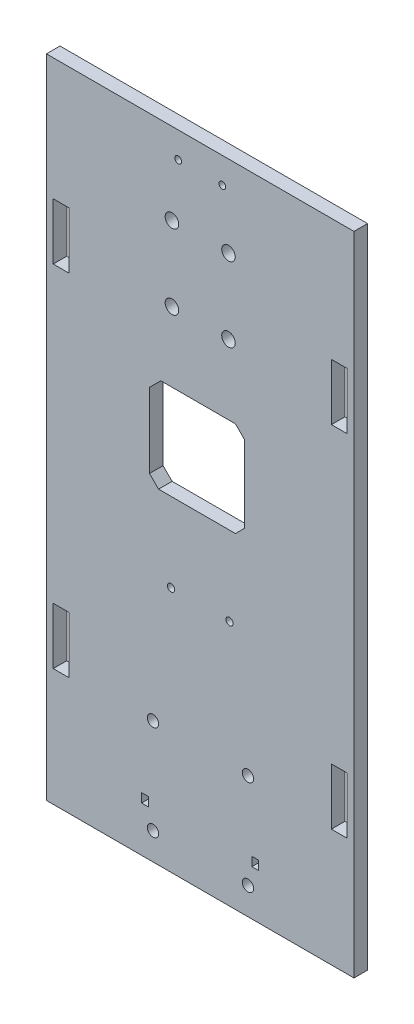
ISO-10303-21;
HEADER;
FILE_DESCRIPTION(('STEP AP214'),'2;1');
FILE_NAME('part.step','',(''),(''),'','','');
FILE_SCHEMA(('AUTOMOTIVE_DESIGN { 1 0 10303 214 1 1 1 1 }'));
ENDSEC;
DATA;
#1=APPLICATION_CONTEXT('core data for automotive mechanical design processes');
#2=APPLICATION_PROTOCOL_DEFINITION('international standard','automotive_design',2000,#1);
#3=PRODUCT_CONTEXT('',#1,'mechanical');
#4=PRODUCT('Part','Part','',(#3));
#5=PRODUCT_RELATED_PRODUCT_CATEGORY('part','',(#4));
#6=PRODUCT_DEFINITION_FORMATION('','',#4);
#7=PRODUCT_DEFINITION_CONTEXT('part definition',#1,'design');
#8=PRODUCT_DEFINITION('design','',#6,#7);
#9=PRODUCT_DEFINITION_SHAPE('','',#8);
#10=(LENGTH_UNIT() NAMED_UNIT(*) SI_UNIT(.MILLI.,.METRE.));
#11=(NAMED_UNIT(*) PLANE_ANGLE_UNIT() SI_UNIT($,.RADIAN.));
#12=(NAMED_UNIT(*) SI_UNIT($,.STERADIAN.) SOLID_ANGLE_UNIT());
#13=UNCERTAINTY_MEASURE_WITH_UNIT(LENGTH_MEASURE(1.E-05),#10,'distance_accuracy_value','');
#14=(GEOMETRIC_REPRESENTATION_CONTEXT(3) GLOBAL_UNCERTAINTY_ASSIGNED_CONTEXT((#13)) GLOBAL_UNIT_ASSIGNED_CONTEXT((#10,
#11,#12)) REPRESENTATION_CONTEXT('',''));
#15=CARTESIAN_POINT('',(0.,0.,0.));
#16=DIRECTION('',(0.,0.,1.));
#17=DIRECTION('',(1.,0.,0.));
#18=AXIS2_PLACEMENT_3D('',#15,#16,#17);
#19=CARTESIAN_POINT('',(-36.7162383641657,0.,6.));
#20=DIRECTION('',(-1.,0.,0.));
#21=DIRECTION('',(0.,0.,1.));
#22=AXIS2_PLACEMENT_3D('',#19,#20,#21);
#23=PLANE('',#22);
#24=DIRECTION('',(0.,1.,0.));
#25=VECTOR('',#24,1.);
#26=CARTESIAN_POINT('',(-36.7162383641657,0.,0.));
#27=LINE('',#26,#25);
#28=CARTESIAN_POINT('',(-36.7162383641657,-138.08041612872,0.));
#29=VERTEX_POINT('',#28);
#30=CARTESIAN_POINT('',(-36.7162383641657,-134.08041612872,0.));
#31=VERTEX_POINT('',#30);
#32=EDGE_CURVE('E431',#29,#31,#27,.T.);
#33=ORIENTED_EDGE('',*,*,#32,.T.);
#34=DIRECTION('',(0.,0.,-1.));
#35=VECTOR('',#34,1.);
#36=CARTESIAN_POINT('',(-36.7162383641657,-134.08041612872,6.));
#37=LINE('',#36,#35);
#38=CARTESIAN_POINT('',(-36.7162383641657,-134.08041612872,6.));
#39=VERTEX_POINT('',#38);
#40=EDGE_CURVE('E11',#39,#31,#37,.T.);
#41=ORIENTED_EDGE('',*,*,#40,.F.);
#42=DIRECTION('',(0.,1.,0.));
#43=VECTOR('',#42,1.);
#44=CARTESIAN_POINT('',(-36.7162383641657,0.,6.));
#45=LINE('',#44,#43);
#46=CARTESIAN_POINT('',(-36.7162383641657,-138.08041612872,6.));
#47=VERTEX_POINT('',#46);
#48=EDGE_CURVE('E287',#47,#39,#45,.T.);
#49=ORIENTED_EDGE('',*,*,#48,.F.);
#50=DIRECTION('',(0.,0.,-1.));
#51=VECTOR('',#50,1.);
#52=CARTESIAN_POINT('',(-36.7162383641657,-138.08041612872,6.));
#53=LINE('',#52,#51);
#54=EDGE_CURVE('E443',#47,#29,#53,.T.);
#55=ORIENTED_EDGE('',*,*,#54,.T.);
#56=EDGE_LOOP('',(#33,#41,#49,#55));
#57=FACE_BOUND('',#56,.T.);
#58=ADVANCED_FACE('F35',(#57),#23,.F.);
#59=CARTESIAN_POINT('',(0.,-134.08041612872,6.));
#60=DIRECTION('',(0.,1.,0.));
#61=DIRECTION('',(0.,0.,1.));
#62=AXIS2_PLACEMENT_3D('',#59,#60,#61);
#63=PLANE('',#62);
#64=DIRECTION('',(1.,0.,0.));
#65=VECTOR('',#64,1.);
#66=CARTESIAN_POINT('',(0.,-134.08041612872,0.));
#67=LINE('',#66,#65);
#68=CARTESIAN_POINT('',(-33.7162383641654,-134.08041612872,0.));
#69=VERTEX_POINT('',#68);
#70=EDGE_CURVE('E292',#31,#69,#67,.T.);
#71=ORIENTED_EDGE('',*,*,#70,.T.);
#72=DIRECTION('',(0.,0.,-1.));
#73=VECTOR('',#72,1.);
#74=CARTESIAN_POINT('',(-33.7162383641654,-134.08041612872,6.));
#75=LINE('',#74,#73);
#76=CARTESIAN_POINT('',(-33.7162383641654,-134.08041612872,6.));
#77=VERTEX_POINT('',#76);
#78=EDGE_CURVE('E45',#77,#69,#75,.T.);
#79=ORIENTED_EDGE('',*,*,#78,.F.);
#80=DIRECTION('',(1.,0.,0.));
#81=VECTOR('',#80,1.);
#82=CARTESIAN_POINT('',(0.,-134.08041612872,6.));
#83=LINE('',#82,#81);
#84=EDGE_CURVE('E280',#39,#77,#83,.T.);
#85=ORIENTED_EDGE('',*,*,#84,.F.);
#86=ORIENTED_EDGE('',*,*,#40,.T.);
#87=EDGE_LOOP('',(#71,#79,#85,#86));
#88=FACE_BOUND('',#87,.T.);
#89=ADVANCED_FACE('F291',(#88),#63,.F.);
#90=CARTESIAN_POINT('',(-33.7162383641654,0.,6.));
#91=DIRECTION('',(1.,0.,0.));
#92=DIRECTION('',(0.,0.,-1.));
#93=AXIS2_PLACEMENT_3D('',#90,#91,#92);
#94=PLANE('',#93);
#95=DIRECTION('',(0.,-1.,0.));
#96=VECTOR('',#95,1.);
#97=CARTESIAN_POINT('',(-33.7162383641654,0.,0.));
#98=LINE('',#97,#96);
#99=CARTESIAN_POINT('',(-33.7162383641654,-138.08041612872,0.));
#100=VERTEX_POINT('',#99);
#101=EDGE_CURVE('E167',#69,#100,#98,.T.);
#102=ORIENTED_EDGE('',*,*,#101,.T.);
#103=DIRECTION('',(0.,0.,-1.));
#104=VECTOR('',#103,1.);
#105=CARTESIAN_POINT('',(-33.7162383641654,-138.08041612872,6.));
#106=LINE('',#105,#104);
#107=CARTESIAN_POINT('',(-33.7162383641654,-138.08041612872,6.));
#108=VERTEX_POINT('',#107);
#109=EDGE_CURVE('E293',#108,#100,#106,.T.);
#110=ORIENTED_EDGE('',*,*,#109,.F.);
#111=DIRECTION('',(0.,-1.,0.));
#112=VECTOR('',#111,1.);
#113=CARTESIAN_POINT('',(-33.7162383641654,0.,6.));
#114=LINE('',#113,#112);
#115=EDGE_CURVE('E285',#77,#108,#114,.T.);
#116=ORIENTED_EDGE('',*,*,#115,.F.);
#117=ORIENTED_EDGE('',*,*,#78,.T.);
#118=EDGE_LOOP('',(#102,#110,#116,#117));
#119=FACE_BOUND('',#118,.T.);
#120=ADVANCED_FACE('F295',(#119),#94,.F.);
#121=CARTESIAN_POINT('',(0.,-134.075480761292,6.));
#122=DIRECTION('',(0.,-1.,0.));
#123=DIRECTION('',(0.,0.,-1.));
#124=AXIS2_PLACEMENT_3D('',#121,#122,#123);
#125=PLANE('',#124);
#126=DIRECTION('',(-1.,0.,0.));
#127=VECTOR('',#126,1.);
#128=CARTESIAN_POINT('',(0.,-134.075480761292,0.));
#129=LINE('',#128,#127);
#130=CARTESIAN_POINT('',(15.0518680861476,-134.075480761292,0.));
#131=VERTEX_POINT('',#130);
#132=CARTESIAN_POINT('',(12.0518680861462,-134.075480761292,0.));
#133=VERTEX_POINT('',#132);
#134=EDGE_CURVE('E419',#131,#133,#129,.T.);
#135=ORIENTED_EDGE('',*,*,#134,.F.);
#136=DIRECTION('',(0.,0.,-1.));
#137=VECTOR('',#136,1.);
#138=CARTESIAN_POINT('',(15.0518680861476,-134.075480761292,6.));
#139=LINE('',#138,#137);
#140=CARTESIAN_POINT('',(15.0518680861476,-134.075480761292,6.));
#141=VERTEX_POINT('',#140);
#142=EDGE_CURVE('E445',#141,#131,#139,.T.);
#143=ORIENTED_EDGE('',*,*,#142,.F.);
#144=DIRECTION('',(-1.,0.,0.));
#145=VECTOR('',#144,1.);
#146=CARTESIAN_POINT('',(0.,-134.075480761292,6.));
#147=LINE('',#146,#145);
#148=CARTESIAN_POINT('',(12.0518680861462,-134.075480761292,6.));
#149=VERTEX_POINT('',#148);
#150=EDGE_CURVE('E636',#141,#149,#147,.T.);
#151=ORIENTED_EDGE('',*,*,#150,.T.);
#152=DIRECTION('',(0.,0.,-1.));
#153=VECTOR('',#152,1.);
#154=CARTESIAN_POINT('',(12.0518680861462,-134.075480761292,6.));
#155=LINE('',#154,#153);
#156=EDGE_CURVE('E447',#149,#133,#155,.T.);
#157=ORIENTED_EDGE('',*,*,#156,.T.);
#158=EDGE_LOOP('',(#135,#143,#151,#157));
#159=FACE_BOUND('',#158,.T.);
#160=ADVANCED_FACE('F663',(#159),#125,.T.);
#161=CARTESIAN_POINT('',(15.0518680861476,0.,6.));
#162=DIRECTION('',(-1.,0.,0.));
#163=DIRECTION('',(0.,0.,1.));
#164=AXIS2_PLACEMENT_3D('',#161,#162,#163);
#165=PLANE('',#164);
#166=DIRECTION('',(0.,1.,0.));
#167=VECTOR('',#166,1.);
#168=CARTESIAN_POINT('',(15.0518680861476,0.,0.));
#169=LINE('',#168,#167);
#170=CARTESIAN_POINT('',(15.0518680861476,-138.075480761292,0.));
#171=VERTEX_POINT('',#170);
#172=EDGE_CURVE('E422',#171,#131,#169,.T.);
#173=ORIENTED_EDGE('',*,*,#172,.F.);
#174=DIRECTION('',(0.,0.,-1.));
#175=VECTOR('',#174,1.);
#176=CARTESIAN_POINT('',(15.0518680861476,-138.075480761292,6.));
#177=LINE('',#176,#175);
#178=CARTESIAN_POINT('',(15.0518680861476,-138.075480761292,6.));
#179=VERTEX_POINT('',#178);
#180=EDGE_CURVE('E452',#179,#171,#177,.T.);
#181=ORIENTED_EDGE('',*,*,#180,.F.);
#182=DIRECTION('',(0.,1.,0.));
#183=VECTOR('',#182,1.);
#184=CARTESIAN_POINT('',(15.0518680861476,0.,6.));
#185=LINE('',#184,#183);
#186=EDGE_CURVE('E639',#179,#141,#185,.T.);
#187=ORIENTED_EDGE('',*,*,#186,.T.);
#188=ORIENTED_EDGE('',*,*,#142,.T.);
#189=EDGE_LOOP('',(#173,#181,#187,#188));
#190=FACE_BOUND('',#189,.T.);
#191=ADVANCED_FACE('F665',(#190),#165,.T.);
#192=CARTESIAN_POINT('',(0.,-138.075480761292,6.));
#193=DIRECTION('',(0.,1.,0.));
#194=DIRECTION('',(0.,0.,1.));
#195=AXIS2_PLACEMENT_3D('',#192,#193,#194);
#196=PLANE('',#195);
#197=DIRECTION('',(1.,0.,0.));
#198=VECTOR('',#197,1.);
#199=CARTESIAN_POINT('',(0.,-138.075480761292,0.));
#200=LINE('',#199,#198);
#201=CARTESIAN_POINT('',(12.0518680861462,-138.075480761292,0.));
#202=VERTEX_POINT('',#201);
#203=EDGE_CURVE('E425',#202,#171,#200,.T.);
#204=ORIENTED_EDGE('',*,*,#203,.F.);
#205=DIRECTION('',(0.,0.,-1.));
#206=VECTOR('',#205,1.);
#207=CARTESIAN_POINT('',(12.0518680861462,-138.075480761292,6.));
#208=LINE('',#207,#206);
#209=CARTESIAN_POINT('',(12.0518680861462,-138.075480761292,6.));
#210=VERTEX_POINT('',#209);
#211=EDGE_CURVE('E449',#210,#202,#208,.T.);
#212=ORIENTED_EDGE('',*,*,#211,.F.);
#213=DIRECTION('',(1.,0.,0.));
#214=VECTOR('',#213,1.);
#215=CARTESIAN_POINT('',(0.,-138.075480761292,6.));
#216=LINE('',#215,#214);
#217=EDGE_CURVE('E642',#210,#179,#216,.T.);
#218=ORIENTED_EDGE('',*,*,#217,.T.);
#219=ORIENTED_EDGE('',*,*,#180,.T.);
#220=EDGE_LOOP('',(#204,#212,#218,#219));
#221=FACE_BOUND('',#220,.T.);
#222=ADVANCED_FACE('F657',(#221),#196,.T.);
#223=CARTESIAN_POINT('',(-75.7689795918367,0.,6.));
#224=DIRECTION('',(1.,0.,0.));
#225=DIRECTION('',(0.,0.,-1.));
#226=AXIS2_PLACEMENT_3D('',#223,#224,#225);
#227=PLANE('',#226);
#228=DIRECTION('',(0.,-1.,0.));
#229=VECTOR('',#228,1.);
#230=CARTESIAN_POINT('',(-75.7689795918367,0.,0.));
#231=LINE('',#230,#229);
#232=CARTESIAN_POINT('',(-75.7689795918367,-81.1145403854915,0.));
#233=VERTEX_POINT('',#232);
#234=CARTESIAN_POINT('',(-75.7689795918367,-106.114540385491,0.));
#235=VERTEX_POINT('',#234);
#236=EDGE_CURVE('E407',#233,#235,#231,.T.);
#237=ORIENTED_EDGE('',*,*,#236,.F.);
#238=DIRECTION('',(0.,0.,-1.));
#239=VECTOR('',#238,1.);
#240=CARTESIAN_POINT('',(-75.7689795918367,-81.1145403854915,6.));
#241=LINE('',#240,#239);
#242=CARTESIAN_POINT('',(-75.7689795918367,-81.1145403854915,6.));
#243=VERTEX_POINT('',#242);
#244=EDGE_CURVE('E450',#243,#233,#241,.T.);
#245=ORIENTED_EDGE('',*,*,#244,.F.);
#246=DIRECTION('',(0.,-1.,0.));
#247=VECTOR('',#246,1.);
#248=CARTESIAN_POINT('',(-75.7689795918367,0.,6.));
#249=LINE('',#248,#247);
#250=CARTESIAN_POINT('',(-75.7689795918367,-106.114540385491,6.));
#251=VERTEX_POINT('',#250);
#252=EDGE_CURVE('E624',#243,#251,#249,.T.);
#253=ORIENTED_EDGE('',*,*,#252,.T.);
#254=DIRECTION('',(0.,0.,-1.));
#255=VECTOR('',#254,1.);
#256=CARTESIAN_POINT('',(-75.7689795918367,-106.114540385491,6.));
#257=LINE('',#256,#255);
#258=EDGE_CURVE('E455',#251,#235,#257,.T.);
#259=ORIENTED_EDGE('',*,*,#258,.T.);
#260=EDGE_LOOP('',(#237,#245,#253,#259));
#261=FACE_BOUND('',#260,.T.);
#262=ADVANCED_FACE('F672',(#261),#227,.T.);
#263=CARTESIAN_POINT('',(0.,-81.1145403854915,6.));
#264=DIRECTION('',(0.,-1.,0.));
#265=DIRECTION('',(0.,0.,-1.));
#266=AXIS2_PLACEMENT_3D('',#263,#264,#265);
#267=PLANE('',#266);
#268=DIRECTION('',(-1.,0.,0.));
#269=VECTOR('',#268,1.);
#270=CARTESIAN_POINT('',(0.,-81.1145403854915,0.));
#271=LINE('',#270,#269);
#272=CARTESIAN_POINT('',(-68.7689795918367,-81.1145403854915,0.));
#273=VERTEX_POINT('',#272);
#274=EDGE_CURVE('E410',#273,#233,#271,.T.);
#275=ORIENTED_EDGE('',*,*,#274,.F.);
#276=DIRECTION('',(0.,0.,-1.));
#277=VECTOR('',#276,1.);
#278=CARTESIAN_POINT('',(-68.7689795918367,-81.1145403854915,6.));
#279=LINE('',#278,#277);
#280=CARTESIAN_POINT('',(-68.7689795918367,-81.1145403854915,6.));
#281=VERTEX_POINT('',#280);
#282=EDGE_CURVE('E460',#281,#273,#279,.T.);
#283=ORIENTED_EDGE('',*,*,#282,.F.);
#284=DIRECTION('',(-1.,0.,0.));
#285=VECTOR('',#284,1.);
#286=CARTESIAN_POINT('',(0.,-81.1145403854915,6.));
#287=LINE('',#286,#285);
#288=EDGE_CURVE('E627',#281,#243,#287,.T.);
#289=ORIENTED_EDGE('',*,*,#288,.T.);
#290=ORIENTED_EDGE('',*,*,#244,.T.);
#291=EDGE_LOOP('',(#275,#283,#289,#290));
#292=FACE_BOUND('',#291,.T.);
#293=ADVANCED_FACE('F731',(#292),#267,.T.);
#294=CARTESIAN_POINT('',(-68.7689795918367,0.,6.));
#295=DIRECTION('',(-1.,0.,0.));
#296=DIRECTION('',(0.,0.,1.));
#297=AXIS2_PLACEMENT_3D('',#294,#295,#296);
#298=PLANE('',#297);
#299=DIRECTION('',(0.,1.,0.));
#300=VECTOR('',#299,1.);
#301=CARTESIAN_POINT('',(-68.7689795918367,0.,0.));
#302=LINE('',#301,#300);
#303=CARTESIAN_POINT('',(-68.7689795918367,-106.114540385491,0.));
#304=VERTEX_POINT('',#303);
#305=EDGE_CURVE('E413',#304,#273,#302,.T.);
#306=ORIENTED_EDGE('',*,*,#305,.F.);
#307=DIRECTION('',(0.,0.,-1.));
#308=VECTOR('',#307,1.);
#309=CARTESIAN_POINT('',(-68.7689795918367,-106.114540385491,6.));
#310=LINE('',#309,#308);
#311=CARTESIAN_POINT('',(-68.7689795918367,-106.114540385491,6.));
#312=VERTEX_POINT('',#311);
#313=EDGE_CURVE('E457',#312,#304,#310,.T.);
#314=ORIENTED_EDGE('',*,*,#313,.F.);
#315=DIRECTION('',(0.,1.,0.));
#316=VECTOR('',#315,1.);
#317=CARTESIAN_POINT('',(-68.7689795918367,0.,6.));
#318=LINE('',#317,#316);
#319=EDGE_CURVE('E630',#312,#281,#318,.T.);
#320=ORIENTED_EDGE('',*,*,#319,.T.);
#321=ORIENTED_EDGE('',*,*,#282,.T.);
#322=EDGE_LOOP('',(#306,#314,#320,#321));
#323=FACE_BOUND('',#322,.T.);
#324=ADVANCED_FACE('F741',(#323),#298,.T.);
#325=CARTESIAN_POINT('',(-75.7689795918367,0.,6.));
#326=DIRECTION('',(1.,0.,0.));
#327=DIRECTION('',(0.,0.,-1.));
#328=AXIS2_PLACEMENT_3D('',#325,#326,#327);
#329=PLANE('',#328);
#330=DIRECTION('',(0.,-1.,0.));
#331=VECTOR('',#330,1.);
#332=CARTESIAN_POINT('',(-75.7689795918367,0.,0.));
#333=LINE('',#332,#331);
#334=CARTESIAN_POINT('',(-75.7689795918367,73.8076016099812,0.));
#335=VERTEX_POINT('',#334);
#336=CARTESIAN_POINT('',(-75.7689795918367,48.8076016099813,0.));
#337=VERTEX_POINT('',#336);
#338=EDGE_CURVE('E395',#335,#337,#333,.T.);
#339=ORIENTED_EDGE('',*,*,#338,.F.);
#340=DIRECTION('',(0.,0.,-1.));
#341=VECTOR('',#340,1.);
#342=CARTESIAN_POINT('',(-75.7689795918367,73.8076016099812,6.));
#343=LINE('',#342,#341);
#344=CARTESIAN_POINT('',(-75.7689795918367,73.8076016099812,6.));
#345=VERTEX_POINT('',#344);
#346=EDGE_CURVE('E458',#345,#335,#343,.T.);
#347=ORIENTED_EDGE('',*,*,#346,.F.);
#348=DIRECTION('',(0.,-1.,0.));
#349=VECTOR('',#348,1.);
#350=CARTESIAN_POINT('',(-75.7689795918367,0.,6.));
#351=LINE('',#350,#349);
#352=CARTESIAN_POINT('',(-75.7689795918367,48.8076016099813,6.));
#353=VERTEX_POINT('',#352);
#354=EDGE_CURVE('E612',#345,#353,#351,.T.);
#355=ORIENTED_EDGE('',*,*,#354,.T.);
#356=DIRECTION('',(0.,0.,-1.));
#357=VECTOR('',#356,1.);
#358=CARTESIAN_POINT('',(-75.7689795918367,48.8076016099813,6.));
#359=LINE('',#358,#357);
#360=EDGE_CURVE('E463',#353,#337,#359,.T.);
#361=ORIENTED_EDGE('',*,*,#360,.T.);
#362=EDGE_LOOP('',(#339,#347,#355,#361));
#363=FACE_BOUND('',#362,.T.);
#364=ADVANCED_FACE('F751',(#363),#329,.T.);
#365=CARTESIAN_POINT('',(0.,73.8076016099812,6.));
#366=DIRECTION('',(0.,-1.,0.));
#367=DIRECTION('',(0.,0.,-1.));
#368=AXIS2_PLACEMENT_3D('',#365,#366,#367);
#369=PLANE('',#368);
#370=DIRECTION('',(-1.,0.,0.));
#371=VECTOR('',#370,1.);
#372=CARTESIAN_POINT('',(0.,73.8076016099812,0.));
#373=LINE('',#372,#371);
#374=CARTESIAN_POINT('',(-68.7689795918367,73.8076016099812,0.));
#375=VERTEX_POINT('',#374);
#376=EDGE_CURVE('E398',#375,#335,#373,.T.);
#377=ORIENTED_EDGE('',*,*,#376,.F.);
#378=DIRECTION('',(0.,0.,-1.));
#379=VECTOR('',#378,1.);
#380=CARTESIAN_POINT('',(-68.7689795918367,73.8076016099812,6.));
#381=LINE('',#380,#379);
#382=CARTESIAN_POINT('',(-68.7689795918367,73.8076016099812,6.));
#383=VERTEX_POINT('',#382);
#384=EDGE_CURVE('E468',#383,#375,#381,.T.);
#385=ORIENTED_EDGE('',*,*,#384,.F.);
#386=DIRECTION('',(-1.,0.,0.));
#387=VECTOR('',#386,1.);
#388=CARTESIAN_POINT('',(0.,73.8076016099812,6.));
#389=LINE('',#388,#387);
#390=EDGE_CURVE('E615',#383,#345,#389,.T.);
#391=ORIENTED_EDGE('',*,*,#390,.T.);
#392=ORIENTED_EDGE('',*,*,#346,.T.);
#393=EDGE_LOOP('',(#377,#385,#391,#392));
#394=FACE_BOUND('',#393,.T.);
#395=ADVANCED_FACE('F761',(#394),#369,.T.);
#396=CARTESIAN_POINT('',(-68.7689795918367,0.,6.));
#397=DIRECTION('',(-1.,0.,0.));
#398=DIRECTION('',(0.,0.,1.));
#399=AXIS2_PLACEMENT_3D('',#396,#397,#398);
#400=PLANE('',#399);
#401=DIRECTION('',(0.,1.,0.));
#402=VECTOR('',#401,1.);
#403=CARTESIAN_POINT('',(-68.7689795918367,0.,0.));
#404=LINE('',#403,#402);
#405=CARTESIAN_POINT('',(-68.7689795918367,48.8076016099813,0.));
#406=VERTEX_POINT('',#405);
#407=EDGE_CURVE('E401',#406,#375,#404,.T.);
#408=ORIENTED_EDGE('',*,*,#407,.F.);
#409=DIRECTION('',(0.,0.,-1.));
#410=VECTOR('',#409,1.);
#411=CARTESIAN_POINT('',(-68.7689795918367,48.8076016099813,6.));
#412=LINE('',#411,#410);
#413=CARTESIAN_POINT('',(-68.7689795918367,48.8076016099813,6.));
#414=VERTEX_POINT('',#413);
#415=EDGE_CURVE('E465',#414,#406,#412,.T.);
#416=ORIENTED_EDGE('',*,*,#415,.F.);
#417=DIRECTION('',(0.,1.,0.));
#418=VECTOR('',#417,1.);
#419=CARTESIAN_POINT('',(-68.7689795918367,0.,6.));
#420=LINE('',#419,#418);
#421=EDGE_CURVE('E618',#414,#383,#420,.T.);
#422=ORIENTED_EDGE('',*,*,#421,.T.);
#423=ORIENTED_EDGE('',*,*,#384,.T.);
#424=EDGE_LOOP('',(#408,#416,#422,#423));
#425=FACE_BOUND('',#424,.T.);
#426=ADVANCED_FACE('F771',(#425),#400,.T.);
#427=CARTESIAN_POINT('',(54.2310204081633,0.,6.));
#428=DIRECTION('',(-1.,0.,0.));
#429=DIRECTION('',(0.,0.,1.));
#430=AXIS2_PLACEMENT_3D('',#427,#428,#429);
#431=PLANE('',#430);
#432=DIRECTION('',(0.,1.,0.));
#433=VECTOR('',#432,1.);
#434=CARTESIAN_POINT('',(54.2310204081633,0.,0.));
#435=LINE('',#434,#433);
#436=CARTESIAN_POINT('',(54.2310204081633,48.8076016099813,0.));
#437=VERTEX_POINT('',#436);
#438=CARTESIAN_POINT('',(54.2310204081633,73.8076016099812,0.));
#439=VERTEX_POINT('',#438);
#440=EDGE_CURVE('E383',#437,#439,#435,.T.);
#441=ORIENTED_EDGE('',*,*,#440,.F.);
#442=DIRECTION('',(0.,0.,-1.));
#443=VECTOR('',#442,1.);
#444=CARTESIAN_POINT('',(54.2310204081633,48.8076016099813,6.));
#445=LINE('',#444,#443);
#446=CARTESIAN_POINT('',(54.2310204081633,48.8076016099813,6.));
#447=VERTEX_POINT('',#446);
#448=EDGE_CURVE('E466',#447,#437,#445,.T.);
#449=ORIENTED_EDGE('',*,*,#448,.F.);
#450=DIRECTION('',(0.,1.,0.));
#451=VECTOR('',#450,1.);
#452=CARTESIAN_POINT('',(54.2310204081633,0.,6.));
#453=LINE('',#452,#451);
#454=CARTESIAN_POINT('',(54.2310204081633,73.8076016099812,6.));
#455=VERTEX_POINT('',#454);
#456=EDGE_CURVE('E600',#447,#455,#453,.T.);
#457=ORIENTED_EDGE('',*,*,#456,.T.);
#458=DIRECTION('',(0.,0.,-1.));
#459=VECTOR('',#458,1.);
#460=CARTESIAN_POINT('',(54.2310204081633,73.8076016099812,6.));
#461=LINE('',#460,#459);
#462=EDGE_CURVE('E471',#455,#439,#461,.T.);
#463=ORIENTED_EDGE('',*,*,#462,.T.);
#464=EDGE_LOOP('',(#441,#449,#457,#463));
#465=FACE_BOUND('',#464,.T.);
#466=ADVANCED_FACE('F781',(#465),#431,.T.);
#467=CARTESIAN_POINT('',(0.,48.8076016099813,6.));
#468=DIRECTION('',(0.,1.,0.));
#469=DIRECTION('',(0.,0.,1.));
#470=AXIS2_PLACEMENT_3D('',#467,#468,#469);
#471=PLANE('',#470);
#472=DIRECTION('',(1.,0.,0.));
#473=VECTOR('',#472,1.);
#474=CARTESIAN_POINT('',(0.,48.8076016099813,0.));
#475=LINE('',#474,#473);
#476=CARTESIAN_POINT('',(47.2310204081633,48.8076016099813,0.));
#477=VERTEX_POINT('',#476);
#478=EDGE_CURVE('E386',#477,#437,#475,.T.);
#479=ORIENTED_EDGE('',*,*,#478,.F.);
#480=DIRECTION('',(0.,0.,-1.));
#481=VECTOR('',#480,1.);
#482=CARTESIAN_POINT('',(47.2310204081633,48.8076016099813,6.));
#483=LINE('',#482,#481);
#484=CARTESIAN_POINT('',(47.2310204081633,48.8076016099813,6.));
#485=VERTEX_POINT('',#484);
#486=EDGE_CURVE('E476',#485,#477,#483,.T.);
#487=ORIENTED_EDGE('',*,*,#486,.F.);
#488=DIRECTION('',(1.,0.,0.));
#489=VECTOR('',#488,1.);
#490=CARTESIAN_POINT('',(0.,48.8076016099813,6.));
#491=LINE('',#490,#489);
#492=EDGE_CURVE('E603',#485,#447,#491,.T.);
#493=ORIENTED_EDGE('',*,*,#492,.T.);
#494=ORIENTED_EDGE('',*,*,#448,.T.);
#495=EDGE_LOOP('',(#479,#487,#493,#494));
#496=FACE_BOUND('',#495,.T.);
#497=ADVANCED_FACE('F791',(#496),#471,.T.);
#498=CARTESIAN_POINT('',(47.2310204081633,0.,6.));
#499=DIRECTION('',(1.,0.,0.));
#500=DIRECTION('',(0.,0.,-1.));
#501=AXIS2_PLACEMENT_3D('',#498,#499,#500);
#502=PLANE('',#501);
#503=DIRECTION('',(0.,-1.,0.));
#504=VECTOR('',#503,1.);
#505=CARTESIAN_POINT('',(47.2310204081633,0.,0.));
#506=LINE('',#505,#504);
#507=CARTESIAN_POINT('',(47.2310204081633,73.8076016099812,0.));
#508=VERTEX_POINT('',#507);
#509=EDGE_CURVE('E389',#508,#477,#506,.T.);
#510=ORIENTED_EDGE('',*,*,#509,.F.);
#511=DIRECTION('',(0.,0.,-1.));
#512=VECTOR('',#511,1.);
#513=CARTESIAN_POINT('',(47.2310204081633,73.8076016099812,6.));
#514=LINE('',#513,#512);
#515=CARTESIAN_POINT('',(47.2310204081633,73.8076016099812,6.));
#516=VERTEX_POINT('',#515);
#517=EDGE_CURVE('E473',#516,#508,#514,.T.);
#518=ORIENTED_EDGE('',*,*,#517,.F.);
#519=DIRECTION('',(0.,-1.,0.));
#520=VECTOR('',#519,1.);
#521=CARTESIAN_POINT('',(47.2310204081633,0.,6.));
#522=LINE('',#521,#520);
#523=EDGE_CURVE('E606',#516,#485,#522,.T.);
#524=ORIENTED_EDGE('',*,*,#523,.T.);
#525=ORIENTED_EDGE('',*,*,#486,.T.);
#526=EDGE_LOOP('',(#510,#518,#524,#525));
#527=FACE_BOUND('',#526,.T.);
#528=ADVANCED_FACE('F801',(#527),#502,.T.);
#529=CARTESIAN_POINT('',(54.2310204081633,0.,6.));
#530=DIRECTION('',(-1.,0.,0.));
#531=DIRECTION('',(0.,0.,1.));
#532=AXIS2_PLACEMENT_3D('',#529,#530,#531);
#533=PLANE('',#532);
#534=DIRECTION('',(0.,1.,0.));
#535=VECTOR('',#534,1.);
#536=CARTESIAN_POINT('',(54.2310204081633,0.,0.));
#537=LINE('',#536,#535);
#538=CARTESIAN_POINT('',(54.2310204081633,-106.114540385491,0.));
#539=VERTEX_POINT('',#538);
#540=CARTESIAN_POINT('',(54.2310204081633,-81.1145403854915,0.));
#541=VERTEX_POINT('',#540);
#542=EDGE_CURVE('E371',#539,#541,#537,.T.);
#543=ORIENTED_EDGE('',*,*,#542,.F.);
#544=DIRECTION('',(0.,0.,-1.));
#545=VECTOR('',#544,1.);
#546=CARTESIAN_POINT('',(54.2310204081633,-106.114540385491,6.));
#547=LINE('',#546,#545);
#548=CARTESIAN_POINT('',(54.2310204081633,-106.114540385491,6.));
#549=VERTEX_POINT('',#548);
#550=EDGE_CURVE('E474',#549,#539,#547,.T.);
#551=ORIENTED_EDGE('',*,*,#550,.F.);
#552=DIRECTION('',(0.,1.,0.));
#553=VECTOR('',#552,1.);
#554=CARTESIAN_POINT('',(54.2310204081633,0.,6.));
#555=LINE('',#554,#553);
#556=CARTESIAN_POINT('',(54.2310204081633,-81.1145403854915,6.));
#557=VERTEX_POINT('',#556);
#558=EDGE_CURVE('E588',#549,#557,#555,.T.);
#559=ORIENTED_EDGE('',*,*,#558,.T.);
#560=DIRECTION('',(0.,0.,-1.));
#561=VECTOR('',#560,1.);
#562=CARTESIAN_POINT('',(54.2310204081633,-81.1145403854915,6.));
#563=LINE('',#562,#561);
#564=EDGE_CURVE('E479',#557,#541,#563,.T.);
#565=ORIENTED_EDGE('',*,*,#564,.T.);
#566=EDGE_LOOP('',(#543,#551,#559,#565));
#567=FACE_BOUND('',#566,.T.);
#568=ADVANCED_FACE('F811',(#567),#533,.T.);
#569=CARTESIAN_POINT('',(0.,-106.114540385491,6.));
#570=DIRECTION('',(0.,1.,0.));
#571=DIRECTION('',(0.,0.,1.));
#572=AXIS2_PLACEMENT_3D('',#569,#570,#571);
#573=PLANE('',#572);
#574=DIRECTION('',(1.,0.,0.));
#575=VECTOR('',#574,1.);
#576=CARTESIAN_POINT('',(0.,-106.114540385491,0.));
#577=LINE('',#576,#575);
#578=CARTESIAN_POINT('',(47.2310204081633,-106.114540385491,0.));
#579=VERTEX_POINT('',#578);
#580=EDGE_CURVE('E374',#579,#539,#577,.T.);
#581=ORIENTED_EDGE('',*,*,#580,.F.);
#582=DIRECTION('',(0.,0.,-1.));
#583=VECTOR('',#582,1.);
#584=CARTESIAN_POINT('',(47.2310204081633,-106.114540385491,6.));
#585=LINE('',#584,#583);
#586=CARTESIAN_POINT('',(47.2310204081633,-106.114540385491,6.));
#587=VERTEX_POINT('',#586);
#588=EDGE_CURVE('E484',#587,#579,#585,.T.);
#589=ORIENTED_EDGE('',*,*,#588,.F.);
#590=DIRECTION('',(1.,0.,0.));
#591=VECTOR('',#590,1.);
#592=CARTESIAN_POINT('',(0.,-106.114540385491,6.));
#593=LINE('',#592,#591);
#594=EDGE_CURVE('E591',#587,#549,#593,.T.);
#595=ORIENTED_EDGE('',*,*,#594,.T.);
#596=ORIENTED_EDGE('',*,*,#550,.T.);
#597=EDGE_LOOP('',(#581,#589,#595,#596));
#598=FACE_BOUND('',#597,.T.);
#599=ADVANCED_FACE('F821',(#598),#573,.T.);
#600=CARTESIAN_POINT('',(47.2310204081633,0.,6.));
#601=DIRECTION('',(1.,0.,0.));
#602=DIRECTION('',(0.,0.,-1.));
#603=AXIS2_PLACEMENT_3D('',#600,#601,#602);
#604=PLANE('',#603);
#605=DIRECTION('',(0.,-1.,0.));
#606=VECTOR('',#605,1.);
#607=CARTESIAN_POINT('',(47.2310204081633,0.,0.));
#608=LINE('',#607,#606);
#609=CARTESIAN_POINT('',(47.2310204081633,-81.1145403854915,0.));
#610=VERTEX_POINT('',#609);
#611=EDGE_CURVE('E377',#610,#579,#608,.T.);
#612=ORIENTED_EDGE('',*,*,#611,.F.);
#613=DIRECTION('',(0.,0.,-1.));
#614=VECTOR('',#613,1.);
#615=CARTESIAN_POINT('',(47.2310204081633,-81.1145403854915,6.));
#616=LINE('',#615,#614);
#617=CARTESIAN_POINT('',(47.2310204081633,-81.1145403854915,6.));
#618=VERTEX_POINT('',#617);
#619=EDGE_CURVE('E481',#618,#610,#616,.T.);
#620=ORIENTED_EDGE('',*,*,#619,.F.);
#621=DIRECTION('',(0.,-1.,0.));
#622=VECTOR('',#621,1.);
#623=CARTESIAN_POINT('',(47.2310204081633,0.,6.));
#624=LINE('',#623,#622);
#625=EDGE_CURVE('E594',#618,#587,#624,.T.);
#626=ORIENTED_EDGE('',*,*,#625,.T.);
#627=ORIENTED_EDGE('',*,*,#588,.T.);
#628=EDGE_LOOP('',(#612,#620,#626,#627));
#629=FACE_BOUND('',#628,.T.);
#630=ADVANCED_FACE('F831',(#629),#604,.T.);
#631=CARTESIAN_POINT('',(0.,-158.114540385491,6.));
#632=DIRECTION('',(0.,1.,0.));
#633=DIRECTION('',(0.,0.,1.));
#634=AXIS2_PLACEMENT_3D('',#631,#632,#633);
#635=PLANE('',#634);
#636=DIRECTION('',(1.,0.,0.));
#637=VECTOR('',#636,1.);
#638=CARTESIAN_POINT('',(0.,-158.114540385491,0.));
#639=LINE('',#638,#637);
#640=CARTESIAN_POINT('',(-78.7689795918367,-158.114540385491,0.));
#641=VERTEX_POINT('',#640);
#642=CARTESIAN_POINT('',(57.2310204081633,-158.114540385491,0.));
#643=VERTEX_POINT('',#642);
#644=EDGE_CURVE('E360',#641,#643,#639,.T.);
#645=ORIENTED_EDGE('',*,*,#644,.T.);
#646=DIRECTION('',(0.,0.,-1.));
#647=VECTOR('',#646,1.);
#648=CARTESIAN_POINT('',(57.2310204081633,-158.114540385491,6.));
#649=LINE('',#648,#647);
#650=CARTESIAN_POINT('',(57.2310204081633,-158.114540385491,6.));
#651=VERTEX_POINT('',#650);
#652=EDGE_CURVE('E482',#651,#643,#649,.T.);
#653=ORIENTED_EDGE('',*,*,#652,.F.);
#654=DIRECTION('',(1.,0.,0.));
#655=VECTOR('',#654,1.);
#656=CARTESIAN_POINT('',(0.,-158.114540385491,6.));
#657=LINE('',#656,#655);
#658=CARTESIAN_POINT('',(-78.7689795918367,-158.114540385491,6.));
#659=VERTEX_POINT('',#658);
#660=EDGE_CURVE('E578',#659,#651,#657,.T.);
#661=ORIENTED_EDGE('',*,*,#660,.F.);
#662=DIRECTION('',(0.,0.,-1.));
#663=VECTOR('',#662,1.);
#664=CARTESIAN_POINT('',(-78.7689795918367,-158.114540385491,6.));
#665=LINE('',#664,#663);
#666=EDGE_CURVE('E487',#659,#641,#665,.T.);
#667=ORIENTED_EDGE('',*,*,#666,.T.);
#668=EDGE_LOOP('',(#645,#653,#661,#667));
#669=FACE_BOUND('',#668,.T.);
#670=ADVANCED_FACE('F841',(#669),#635,.F.);
#671=CARTESIAN_POINT('',(57.2310204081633,0.,6.));
#672=DIRECTION('',(-1.,0.,0.));
#673=DIRECTION('',(0.,0.,1.));
#674=AXIS2_PLACEMENT_3D('',#671,#672,#673);
#675=PLANE('',#674);
#676=DIRECTION('',(0.,1.,0.));
#677=VECTOR('',#676,1.);
#678=CARTESIAN_POINT('',(57.2310204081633,0.,0.));
#679=LINE('',#678,#677);
#680=CARTESIAN_POINT('',(57.2310204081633,127.807601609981,0.));
#681=VERTEX_POINT('',#680);
#682=EDGE_CURVE('E363',#643,#681,#679,.T.);
#683=ORIENTED_EDGE('',*,*,#682,.T.);
#684=DIRECTION('',(0.,0.,-1.));
#685=VECTOR('',#684,1.);
#686=CARTESIAN_POINT('',(57.2310204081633,127.807601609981,6.));
#687=LINE('',#686,#685);
#688=CARTESIAN_POINT('',(57.2310204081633,127.807601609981,6.));
#689=VERTEX_POINT('',#688);
#690=EDGE_CURVE('E492',#689,#681,#687,.T.);
#691=ORIENTED_EDGE('',*,*,#690,.F.);
#692=DIRECTION('',(0.,1.,0.));
#693=VECTOR('',#692,1.);
#694=CARTESIAN_POINT('',(57.2310204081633,0.,6.));
#695=LINE('',#694,#693);
#696=EDGE_CURVE('E581',#651,#689,#695,.T.);
#697=ORIENTED_EDGE('',*,*,#696,.F.);
#698=ORIENTED_EDGE('',*,*,#652,.T.);
#699=EDGE_LOOP('',(#683,#691,#697,#698));
#700=FACE_BOUND('',#699,.T.);
#701=ADVANCED_FACE('F851',(#700),#675,.F.);
#702=CARTESIAN_POINT('',(0.,127.807601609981,6.));
#703=DIRECTION('',(0.,1.,0.));
#704=DIRECTION('',(0.,0.,1.));
#705=AXIS2_PLACEMENT_3D('',#702,#703,#704);
#706=PLANE('',#705);
#707=DIRECTION('',(1.,0.,0.));
#708=VECTOR('',#707,1.);
#709=CARTESIAN_POINT('',(0.,127.807601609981,0.));
#710=LINE('',#709,#708);
#711=CARTESIAN_POINT('',(-78.7689795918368,127.807601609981,0.));
#712=VERTEX_POINT('',#711);
#713=EDGE_CURVE('E366',#712,#681,#710,.T.);
#714=ORIENTED_EDGE('',*,*,#713,.F.);
#715=DIRECTION('',(0.,0.,-1.));
#716=VECTOR('',#715,1.);
#717=CARTESIAN_POINT('',(-78.7689795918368,127.807601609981,6.));
#718=LINE('',#717,#716);
#719=CARTESIAN_POINT('',(-78.7689795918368,127.807601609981,6.));
#720=VERTEX_POINT('',#719);
#721=EDGE_CURVE('E490',#720,#712,#718,.T.);
#722=ORIENTED_EDGE('',*,*,#721,.F.);
#723=DIRECTION('',(1.,0.,0.));
#724=VECTOR('',#723,1.);
#725=CARTESIAN_POINT('',(0.,127.807601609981,6.));
#726=LINE('',#725,#724);
#727=EDGE_CURVE('E583',#720,#689,#726,.T.);
#728=ORIENTED_EDGE('',*,*,#727,.T.);
#729=ORIENTED_EDGE('',*,*,#690,.T.);
#730=EDGE_LOOP('',(#714,#722,#728,#729));
#731=FACE_BOUND('',#730,.T.);
#732=ADVANCED_FACE('F862',(#731),#706,.T.);
#733=CARTESIAN_POINT('',(0.,-14.1145403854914,6.));
#734=DIRECTION('',(0.,-1.,0.));
#735=DIRECTION('',(0.,0.,-1.));
#736=AXIS2_PLACEMENT_3D('',#733,#734,#735);
#737=PLANE('',#736);
#738=DIRECTION('',(-1.,0.,0.));
#739=VECTOR('',#738,1.);
#740=CARTESIAN_POINT('',(0.,-14.1145403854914,0.));
#741=LINE('',#740,#739);
#742=CARTESIAN_POINT('',(4.80357431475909,-14.1145403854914,0.));
#743=VERTEX_POINT('',#742);
#744=CARTESIAN_POINT('',(-29.1964256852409,-14.1145403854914,0.));
#745=VERTEX_POINT('',#744);
#746=EDGE_CURVE('E307',#743,#745,#741,.T.);
#747=ORIENTED_EDGE('',*,*,#746,.T.);
#748=DIRECTION('',(0.,0.,-1.));
#749=VECTOR('',#748,1.);
#750=CARTESIAN_POINT('',(-29.1964256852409,-14.1145403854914,6.));
#751=LINE('',#750,#749);
#752=CARTESIAN_POINT('',(-29.1964256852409,-14.1145403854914,6.));
#753=VERTEX_POINT('',#752);
#754=EDGE_CURVE('E39',#753,#745,#751,.T.);
#755=ORIENTED_EDGE('',*,*,#754,.F.);
#756=DIRECTION('',(-1.,0.,0.));
#757=VECTOR('',#756,1.);
#758=CARTESIAN_POINT('',(0.,-14.1145403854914,6.));
#759=LINE('',#758,#757);
#760=CARTESIAN_POINT('',(4.80357431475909,-14.1145403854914,6.));
#761=VERTEX_POINT('',#760);
#762=EDGE_CURVE('E182',#761,#753,#759,.T.);
#763=ORIENTED_EDGE('',*,*,#762,.F.);
#764=DIRECTION('',(0.,0.,-1.));
#765=VECTOR('',#764,1.);
#766=CARTESIAN_POINT('',(4.80357431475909,-14.1145403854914,6.));
#767=LINE('',#766,#765);
#768=EDGE_CURVE('E306',#761,#743,#767,.T.);
#769=ORIENTED_EDGE('',*,*,#768,.T.);
#770=EDGE_LOOP('',(#747,#755,#763,#769));
#771=FACE_BOUND('',#770,.T.);
#772=ADVANCED_FACE('F37',(#771),#737,.F.);
#773=CARTESIAN_POINT('',(-21.6554830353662,-21.6554830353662,6.));
#774=DIRECTION('',(0.707106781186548,0.707106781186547,0.));
#775=DIRECTION('',(-0.707106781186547,0.707106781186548,0.));
#776=AXIS2_PLACEMENT_3D('',#773,#774,#775);
#777=PLANE('',#776);
#778=DIRECTION('',(0.707106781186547,-0.707106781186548,0.));
#779=VECTOR('',#778,1.);
#780=CARTESIAN_POINT('',(-21.6554830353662,-21.6554830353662,0.));
#781=LINE('',#780,#779);
#782=CARTESIAN_POINT('',(-33.1964256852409,-10.1145403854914,0.));
#783=VERTEX_POINT('',#782);
#784=EDGE_CURVE('E310',#783,#745,#781,.T.);
#785=ORIENTED_EDGE('',*,*,#784,.F.);
#786=DIRECTION('',(0.,0.,-1.));
#787=VECTOR('',#786,1.);
#788=CARTESIAN_POINT('',(-33.1964256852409,-10.1145403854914,6.));
#789=LINE('',#788,#787);
#790=CARTESIAN_POINT('',(-33.1964256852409,-10.1145403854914,6.));
#791=VERTEX_POINT('',#790);
#792=EDGE_CURVE('E507',#791,#783,#789,.T.);
#793=ORIENTED_EDGE('',*,*,#792,.F.);
#794=DIRECTION('',(0.707106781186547,-0.707106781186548,0.));
#795=VECTOR('',#794,1.);
#796=CARTESIAN_POINT('',(-21.6554830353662,-21.6554830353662,6.));
#797=LINE('',#796,#795);
#798=EDGE_CURVE('E515',#791,#753,#797,.T.);
#799=ORIENTED_EDGE('',*,*,#798,.T.);
#800=ORIENTED_EDGE('',*,*,#754,.T.);
#801=EDGE_LOOP('',(#785,#793,#799,#800));
#802=FACE_BOUND('',#801,.T.);
#803=ADVANCED_FACE('F514',(#802),#777,.T.);
#804=CARTESIAN_POINT('',(-33.1964256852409,0.,6.));
#805=DIRECTION('',(1.,0.,0.));
#806=DIRECTION('',(0.,1.,0.));
#807=AXIS2_PLACEMENT_3D('',#804,#805,#806);
#808=PLANE('',#807);
#809=DIRECTION('',(0.,-1.,0.));
#810=VECTOR('',#809,1.);
#811=CARTESIAN_POINT('',(-33.1964256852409,0.,0.));
#812=LINE('',#811,#810);
#813=CARTESIAN_POINT('',(-33.1964256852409,22.8854596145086,0.));
#814=VERTEX_POINT('',#813);
#815=EDGE_CURVE('E313',#814,#783,#812,.T.);
#816=ORIENTED_EDGE('',*,*,#815,.F.);
#817=DIRECTION('',(0.,0.,-1.));
#818=VECTOR('',#817,1.);
#819=CARTESIAN_POINT('',(-33.1964256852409,22.8854596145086,6.));
#820=LINE('',#819,#818);
#821=CARTESIAN_POINT('',(-33.1964256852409,22.8854596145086,6.));
#822=VERTEX_POINT('',#821);
#823=EDGE_CURVE('E506',#822,#814,#820,.T.);
#824=ORIENTED_EDGE('',*,*,#823,.F.);
#825=DIRECTION('',(0.,-1.,0.));
#826=VECTOR('',#825,1.);
#827=CARTESIAN_POINT('',(-33.1964256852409,0.,6.));
#828=LINE('',#827,#826);
#829=EDGE_CURVE('E526',#822,#791,#828,.T.);
#830=ORIENTED_EDGE('',*,*,#829,.T.);
#831=ORIENTED_EDGE('',*,*,#792,.T.);
#832=EDGE_LOOP('',(#816,#824,#830,#831));
#833=FACE_BOUND('',#832,.T.);
#834=ADVANCED_FACE('F523',(#833),#808,.T.);
#835=CARTESIAN_POINT('',(-28.0409426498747,28.0409426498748,6.));
#836=DIRECTION('',(-0.707106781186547,0.707106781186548,0.));
#837=DIRECTION('',(-0.707106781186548,-0.707106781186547,0.));
#838=AXIS2_PLACEMENT_3D('',#835,#836,#837);
#839=PLANE('',#838);
#840=DIRECTION('',(0.707106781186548,0.707106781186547,0.));
#841=VECTOR('',#840,1.);
#842=CARTESIAN_POINT('',(-28.0409426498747,28.0409426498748,0.));
#843=LINE('',#842,#841);
#844=CARTESIAN_POINT('',(-28.1964256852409,27.8854596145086,0.));
#845=VERTEX_POINT('',#844);
#846=EDGE_CURVE('E316',#814,#845,#843,.T.);
#847=ORIENTED_EDGE('',*,*,#846,.T.);
#848=DIRECTION('',(0.,0.,-1.));
#849=VECTOR('',#848,1.);
#850=CARTESIAN_POINT('',(-28.1964256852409,27.8854596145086,6.));
#851=LINE('',#850,#849);
#852=CARTESIAN_POINT('',(-28.1964256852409,27.8854596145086,6.));
#853=VERTEX_POINT('',#852);
#854=EDGE_CURVE('E504',#853,#845,#851,.T.);
#855=ORIENTED_EDGE('',*,*,#854,.F.);
#856=DIRECTION('',(0.707106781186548,0.707106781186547,0.));
#857=VECTOR('',#856,1.);
#858=CARTESIAN_POINT('',(-28.0409426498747,28.0409426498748,6.));
#859=LINE('',#858,#857);
#860=EDGE_CURVE('E529',#822,#853,#859,.T.);
#861=ORIENTED_EDGE('',*,*,#860,.F.);
#862=ORIENTED_EDGE('',*,*,#823,.T.);
#863=EDGE_LOOP('',(#847,#855,#861,#862));
#864=FACE_BOUND('',#863,.T.);
#865=ADVANCED_FACE('F530',(#864),#839,.F.);
#866=CARTESIAN_POINT('',(0.,27.8854596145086,6.));
#867=DIRECTION('',(0.,-1.,0.));
#868=DIRECTION('',(1.,0.,0.));
#869=AXIS2_PLACEMENT_3D('',#866,#867,#868);
#870=PLANE('',#869);
#871=DIRECTION('',(-1.,0.,0.));
#872=VECTOR('',#871,1.);
#873=CARTESIAN_POINT('',(0.,27.8854596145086,0.));
#874=LINE('',#873,#872);
#875=CARTESIAN_POINT('',(4.80357431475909,27.8854596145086,0.));
#876=VERTEX_POINT('',#875);
#877=EDGE_CURVE('E319',#876,#845,#874,.T.);
#878=ORIENTED_EDGE('',*,*,#877,.F.);
#879=DIRECTION('',(0.,0.,-1.));
#880=VECTOR('',#879,1.);
#881=CARTESIAN_POINT('',(4.80357431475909,27.8854596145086,6.));
#882=LINE('',#881,#880);
#883=CARTESIAN_POINT('',(4.80357431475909,27.8854596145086,6.));
#884=VERTEX_POINT('',#883);
#885=EDGE_CURVE('E502',#884,#876,#882,.T.);
#886=ORIENTED_EDGE('',*,*,#885,.F.);
#887=DIRECTION('',(-1.,0.,0.));
#888=VECTOR('',#887,1.);
#889=CARTESIAN_POINT('',(0.,27.8854596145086,6.));
#890=LINE('',#889,#888);
#891=EDGE_CURVE('E533',#884,#853,#890,.T.);
#892=ORIENTED_EDGE('',*,*,#891,.T.);
#893=ORIENTED_EDGE('',*,*,#854,.T.);
#894=EDGE_LOOP('',(#878,#886,#892,#893));
#895=FACE_BOUND('',#894,.T.);
#896=ADVANCED_FACE('F905',(#895),#870,.T.);
#897=CARTESIAN_POINT('',(16.3445169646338,16.3445169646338,6.));
#898=DIRECTION('',(0.707106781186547,0.707106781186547,0.));
#899=DIRECTION('',(-0.707106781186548,0.707106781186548,0.));
#900=AXIS2_PLACEMENT_3D('',#897,#898,#899);
#901=PLANE('',#900);
#902=DIRECTION('',(0.707106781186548,-0.707106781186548,0.));
#903=VECTOR('',#902,1.);
#904=CARTESIAN_POINT('',(16.3445169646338,16.3445169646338,0.));
#905=LINE('',#904,#903);
#906=CARTESIAN_POINT('',(8.80357431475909,23.8854596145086,0.));
#907=VERTEX_POINT('',#906);
#908=EDGE_CURVE('E322',#876,#907,#905,.T.);
#909=ORIENTED_EDGE('',*,*,#908,.T.);
#910=DIRECTION('',(0.,0.,-1.));
#911=VECTOR('',#910,1.);
#912=CARTESIAN_POINT('',(8.80357431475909,23.8854596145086,6.));
#913=LINE('',#912,#911);
#914=CARTESIAN_POINT('',(8.80357431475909,23.8854596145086,6.));
#915=VERTEX_POINT('',#914);
#916=EDGE_CURVE('E499',#915,#907,#913,.T.);
#917=ORIENTED_EDGE('',*,*,#916,.F.);
#918=DIRECTION('',(0.707106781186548,-0.707106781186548,0.));
#919=VECTOR('',#918,1.);
#920=CARTESIAN_POINT('',(16.3445169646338,16.3445169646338,6.));
#921=LINE('',#920,#919);
#922=EDGE_CURVE('E541',#884,#915,#921,.T.);
#923=ORIENTED_EDGE('',*,*,#922,.F.);
#924=ORIENTED_EDGE('',*,*,#885,.T.);
#925=EDGE_LOOP('',(#909,#917,#923,#924));
#926=FACE_BOUND('',#925,.T.);
#927=ADVANCED_FACE('F914',(#926),#901,.F.);
#928=CARTESIAN_POINT('',(8.80357431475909,0.,6.));
#929=DIRECTION('',(1.,0.,0.));
#930=DIRECTION('',(0.,0.,-1.));
#931=AXIS2_PLACEMENT_3D('',#928,#929,#930);
#932=PLANE('',#931);
#933=DIRECTION('',(0.,-1.,0.));
#934=VECTOR('',#933,1.);
#935=CARTESIAN_POINT('',(8.80357431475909,0.,0.));
#936=LINE('',#935,#934);
#937=CARTESIAN_POINT('',(8.80357431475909,-10.1145403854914,0.));
#938=VERTEX_POINT('',#937);
#939=EDGE_CURVE('E324',#907,#938,#936,.T.);
#940=ORIENTED_EDGE('',*,*,#939,.T.);
#941=DIRECTION('',(0.,0.,-1.));
#942=VECTOR('',#941,1.);
#943=CARTESIAN_POINT('',(8.80357431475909,-10.1145403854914,6.));
#944=LINE('',#943,#942);
#945=CARTESIAN_POINT('',(8.80357431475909,-10.1145403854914,6.));
#946=VERTEX_POINT('',#945);
#947=EDGE_CURVE('E497',#946,#938,#944,.T.);
#948=ORIENTED_EDGE('',*,*,#947,.F.);
#949=DIRECTION('',(0.,-1.,0.));
#950=VECTOR('',#949,1.);
#951=CARTESIAN_POINT('',(8.80357431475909,0.,6.));
#952=LINE('',#951,#950);
#953=EDGE_CURVE('E543',#915,#946,#952,.T.);
#954=ORIENTED_EDGE('',*,*,#953,.F.);
#955=ORIENTED_EDGE('',*,*,#916,.T.);
#956=EDGE_LOOP('',(#940,#948,#954,#955));
#957=FACE_BOUND('',#956,.T.);
#958=ADVANCED_FACE('F699',(#957),#932,.F.);
#959=CARTESIAN_POINT('',(-23.6689795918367,-49.1145403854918,6.));
#960=DIRECTION('',(0.,0.,-1.));
#961=DIRECTION('',(-1.,0.,0.));
#962=AXIS2_PLACEMENT_3D('',#959,#960,#961);
#963=CYLINDRICAL_SURFACE('',#962,1.6);
#964=CARTESIAN_POINT('',(-23.6689795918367,-49.1145403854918,6.));
#965=DIRECTION('',(0.,0.,1.));
#966=DIRECTION('',(1.,0.,0.));
#967=AXIS2_PLACEMENT_3D('',#964,#965,#966);
#968=CIRCLE('',#967,1.6);
#969=CARTESIAN_POINT('',(-22.0689795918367,-49.1145403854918,6.));
#970=VERTEX_POINT('',#969);
#971=EDGE_CURVE('E297',#970,#970,#968,.T.);
#972=ORIENTED_EDGE('',*,*,#971,.T.);
#973=EDGE_LOOP('',(#972));
#974=FACE_BOUND('',#973,.T.);
#975=CARTESIAN_POINT('',(-23.6689795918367,-49.1145403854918,0.));
#976=DIRECTION('',(0.,0.,1.));
#977=DIRECTION('',(1.,0.,0.));
#978=AXIS2_PLACEMENT_3D('',#975,#976,#977);
#979=CIRCLE('',#978,1.6);
#980=CARTESIAN_POINT('',(-22.0689795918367,-49.1145403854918,0.));
#981=VERTEX_POINT('',#980);
#982=EDGE_CURVE('E437',#981,#981,#979,.T.);
#983=ORIENTED_EDGE('',*,*,#982,.F.);
#984=EDGE_LOOP('',(#983));
#985=FACE_BOUND('',#984,.T.);
#986=ADVANCED_FACE('F694',(#974,#985),#963,.F.);
#987=CARTESIAN_POINT('',(0.,-138.08041612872,6.));
#988=DIRECTION('',(0.,-1.,0.));
#989=DIRECTION('',(0.,0.,-1.));
#990=AXIS2_PLACEMENT_3D('',#987,#988,#989);
#991=PLANE('',#990);
#992=DIRECTION('',(-1.,0.,0.));
#993=VECTOR('',#992,1.);
#994=CARTESIAN_POINT('',(0.,-138.08041612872,0.));
#995=LINE('',#994,#993);
#996=EDGE_CURVE('E173',#100,#29,#995,.T.);
#997=ORIENTED_EDGE('',*,*,#996,.T.);
#998=ORIENTED_EDGE('',*,*,#54,.F.);
#999=DIRECTION('',(-1.,0.,0.));
#1000=VECTOR('',#999,1.);
#1001=CARTESIAN_POINT('',(0.,-138.08041612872,6.));
#1002=LINE('',#1001,#1000);
#1003=EDGE_CURVE('E54',#108,#47,#1002,.T.);
#1004=ORIENTED_EDGE('',*,*,#1003,.F.);
#1005=ORIENTED_EDGE('',*,*,#109,.T.);
#1006=EDGE_LOOP('',(#997,#998,#1004,#1005));
#1007=FACE_BOUND('',#1006,.T.);
#1008=ADVANCED_FACE('F686',(#1007),#991,.F.);
#1009=CARTESIAN_POINT('',(12.0518680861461,0.,6.));
#1010=DIRECTION('',(1.,0.,0.));
#1011=DIRECTION('',(0.,1.,0.));
#1012=AXIS2_PLACEMENT_3D('',#1009,#1010,#1011);
#1013=PLANE('',#1012);
#1014=DIRECTION('',(0.,-1.,0.));
#1015=VECTOR('',#1014,1.);
#1016=CARTESIAN_POINT('',(12.0518680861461,0.,0.));
#1017=LINE('',#1016,#1015);
#1018=EDGE_CURVE('E428',#133,#202,#1017,.T.);
#1019=ORIENTED_EDGE('',*,*,#1018,.F.);
#1020=ORIENTED_EDGE('',*,*,#156,.F.);
#1021=DIRECTION('',(0.,-1.,0.));
#1022=VECTOR('',#1021,1.);
#1023=CARTESIAN_POINT('',(12.0518680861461,0.,6.));
#1024=LINE('',#1023,#1022);
#1025=EDGE_CURVE('E645',#149,#210,#1024,.T.);
#1026=ORIENTED_EDGE('',*,*,#1025,.T.);
#1027=ORIENTED_EDGE('',*,*,#211,.T.);
#1028=EDGE_LOOP('',(#1019,#1020,#1026,#1027));
#1029=FACE_BOUND('',#1028,.T.);
#1030=ADVANCED_FACE('F650',(#1029),#1013,.T.);
#1031=CARTESIAN_POINT('',(0.,-106.114540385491,6.));
#1032=DIRECTION('',(0.,1.,0.));
#1033=DIRECTION('',(0.,0.,1.));
#1034=AXIS2_PLACEMENT_3D('',#1031,#1032,#1033);
#1035=PLANE('',#1034);
#1036=DIRECTION('',(1.,0.,0.));
#1037=VECTOR('',#1036,1.);
#1038=CARTESIAN_POINT('',(0.,-106.114540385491,0.));
#1039=LINE('',#1038,#1037);
#1040=EDGE_CURVE('E416',#235,#304,#1039,.T.);
#1041=ORIENTED_EDGE('',*,*,#1040,.F.);
#1042=ORIENTED_EDGE('',*,*,#258,.F.);
#1043=DIRECTION('',(1.,0.,0.));
#1044=VECTOR('',#1043,1.);
#1045=CARTESIAN_POINT('',(0.,-106.114540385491,6.));
#1046=LINE('',#1045,#1044);
#1047=EDGE_CURVE('E633',#251,#312,#1046,.T.);
#1048=ORIENTED_EDGE('',*,*,#1047,.T.);
#1049=ORIENTED_EDGE('',*,*,#313,.T.);
#1050=EDGE_LOOP('',(#1041,#1042,#1048,#1049));
#1051=FACE_BOUND('',#1050,.T.);
#1052=ADVANCED_FACE('F685',(#1051),#1035,.T.);
#1053=CARTESIAN_POINT('',(0.,48.8076016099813,6.));
#1054=DIRECTION('',(0.,1.,0.));
#1055=DIRECTION('',(0.,0.,1.));
#1056=AXIS2_PLACEMENT_3D('',#1053,#1054,#1055);
#1057=PLANE('',#1056);
#1058=DIRECTION('',(1.,0.,0.));
#1059=VECTOR('',#1058,1.);
#1060=CARTESIAN_POINT('',(0.,48.8076016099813,0.));
#1061=LINE('',#1060,#1059);
#1062=EDGE_CURVE('E404',#337,#406,#1061,.T.);
#1063=ORIENTED_EDGE('',*,*,#1062,.F.);
#1064=ORIENTED_EDGE('',*,*,#360,.F.);
#1065=DIRECTION('',(1.,0.,0.));
#1066=VECTOR('',#1065,1.);
#1067=CARTESIAN_POINT('',(0.,48.8076016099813,6.));
#1068=LINE('',#1067,#1066);
#1069=EDGE_CURVE('E621',#353,#414,#1068,.T.);
#1070=ORIENTED_EDGE('',*,*,#1069,.T.);
#1071=ORIENTED_EDGE('',*,*,#415,.T.);
#1072=EDGE_LOOP('',(#1063,#1064,#1070,#1071));
#1073=FACE_BOUND('',#1072,.T.);
#1074=ADVANCED_FACE('F691',(#1073),#1057,.T.);
#1075=CARTESIAN_POINT('',(0.,73.8076016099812,6.));
#1076=DIRECTION('',(0.,-1.,0.));
#1077=DIRECTION('',(0.,0.,-1.));
#1078=AXIS2_PLACEMENT_3D('',#1075,#1076,#1077);
#1079=PLANE('',#1078);
#1080=DIRECTION('',(-1.,0.,0.));
#1081=VECTOR('',#1080,1.);
#1082=CARTESIAN_POINT('',(0.,73.8076016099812,0.));
#1083=LINE('',#1082,#1081);
#1084=EDGE_CURVE('E392',#439,#508,#1083,.T.);
#1085=ORIENTED_EDGE('',*,*,#1084,.F.);
#1086=ORIENTED_EDGE('',*,*,#462,.F.);
#1087=DIRECTION('',(-1.,0.,0.));
#1088=VECTOR('',#1087,1.);
#1089=CARTESIAN_POINT('',(0.,73.8076016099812,6.));
#1090=LINE('',#1089,#1088);
#1091=EDGE_CURVE('E609',#455,#516,#1090,.T.);
#1092=ORIENTED_EDGE('',*,*,#1091,.T.);
#1093=ORIENTED_EDGE('',*,*,#517,.T.);
#1094=EDGE_LOOP('',(#1085,#1086,#1092,#1093));
#1095=FACE_BOUND('',#1094,.T.);
#1096=ADVANCED_FACE('F962',(#1095),#1079,.T.);
#1097=CARTESIAN_POINT('',(0.,-81.1145403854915,6.));
#1098=DIRECTION('',(0.,-1.,0.));
#1099=DIRECTION('',(0.,0.,-1.));
#1100=AXIS2_PLACEMENT_3D('',#1097,#1098,#1099);
#1101=PLANE('',#1100);
#1102=DIRECTION('',(-1.,0.,0.));
#1103=VECTOR('',#1102,1.);
#1104=CARTESIAN_POINT('',(0.,-81.1145403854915,0.));
#1105=LINE('',#1104,#1103);
#1106=EDGE_CURVE('E380',#541,#610,#1105,.T.);
#1107=ORIENTED_EDGE('',*,*,#1106,.F.);
#1108=ORIENTED_EDGE('',*,*,#564,.F.);
#1109=DIRECTION('',(-1.,0.,0.));
#1110=VECTOR('',#1109,1.);
#1111=CARTESIAN_POINT('',(0.,-81.1145403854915,6.));
#1112=LINE('',#1111,#1110);
#1113=EDGE_CURVE('E597',#557,#618,#1112,.T.);
#1114=ORIENTED_EDGE('',*,*,#1113,.T.);
#1115=ORIENTED_EDGE('',*,*,#619,.T.);
#1116=EDGE_LOOP('',(#1107,#1108,#1114,#1115));
#1117=FACE_BOUND('',#1116,.T.);
#1118=ADVANCED_FACE('F972',(#1117),#1101,.T.);
#1119=CARTESIAN_POINT('',(-78.7689795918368,0.,6.));
#1120=DIRECTION('',(1.,0.,0.));
#1121=DIRECTION('',(0.,1.,0.));
#1122=AXIS2_PLACEMENT_3D('',#1119,#1120,#1121);
#1123=PLANE('',#1122);
#1124=DIRECTION('',(0.,-1.,0.));
#1125=VECTOR('',#1124,1.);
#1126=CARTESIAN_POINT('',(-78.7689795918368,0.,0.));
#1127=LINE('',#1126,#1125);
#1128=EDGE_CURVE('E369',#712,#641,#1127,.T.);
#1129=ORIENTED_EDGE('',*,*,#1128,.T.);
#1130=ORIENTED_EDGE('',*,*,#666,.F.);
#1131=DIRECTION('',(0.,-1.,0.));
#1132=VECTOR('',#1131,1.);
#1133=CARTESIAN_POINT('',(-78.7689795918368,0.,6.));
#1134=LINE('',#1133,#1132);
#1135=EDGE_CURVE('E586',#720,#659,#1134,.T.);
#1136=ORIENTED_EDGE('',*,*,#1135,.F.);
#1137=ORIENTED_EDGE('',*,*,#721,.T.);
#1138=EDGE_LOOP('',(#1129,#1130,#1136,#1137));
#1139=FACE_BOUND('',#1138,.T.);
#1140=ADVANCED_FACE('F982',(#1139),#1123,.F.);
#1141=CARTESIAN_POINT('',(-23.2689795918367,58.7386723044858,6.));
#1142=DIRECTION('',(0.,0.,-1.));
#1143=DIRECTION('',(-1.,0.,0.));
#1144=AXIS2_PLACEMENT_3D('',#1141,#1142,#1143);
#1145=CYLINDRICAL_SURFACE('',#1144,3.);
#1146=CARTESIAN_POINT('',(-23.2689795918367,58.7386723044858,6.));
#1147=DIRECTION('',(0.,0.,1.));
#1148=DIRECTION('',(1.,0.,0.));
#1149=AXIS2_PLACEMENT_3D('',#1146,#1147,#1148);
#1150=CIRCLE('',#1149,3.);
#1151=CARTESIAN_POINT('',(-20.2689795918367,58.7386723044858,6.));
#1152=VERTEX_POINT('',#1151);
#1153=EDGE_CURVE('E575',#1152,#1152,#1150,.T.);
#1154=ORIENTED_EDGE('',*,*,#1153,.T.);
#1155=EDGE_LOOP('',(#1154));
#1156=FACE_BOUND('',#1155,.T.);
#1157=CARTESIAN_POINT('',(-23.2689795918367,58.7386723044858,0.));
#1158=DIRECTION('',(0.,0.,1.));
#1159=DIRECTION('',(1.,0.,0.));
#1160=AXIS2_PLACEMENT_3D('',#1157,#1158,#1159);
#1161=CIRCLE('',#1160,3.);
#1162=CARTESIAN_POINT('',(-20.2689795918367,58.7386723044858,0.));
#1163=VERTEX_POINT('',#1162);
#1164=EDGE_CURVE('E357',#1163,#1163,#1161,.T.);
#1165=ORIENTED_EDGE('',*,*,#1164,.F.);
#1166=EDGE_LOOP('',(#1165));
#1167=FACE_BOUND('',#1166,.T.);
#1168=ADVANCED_FACE('F993',(#1156,#1167),#1145,.F.);
#1169=CARTESIAN_POINT('',(2.18681616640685,-49.1145403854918,6.));
#1170=DIRECTION('',(0.,0.,-1.));
#1171=DIRECTION('',(-1.,0.,0.));
#1172=AXIS2_PLACEMENT_3D('',#1169,#1170,#1171);
#1173=CYLINDRICAL_SURFACE('',#1172,1.6);
#1174=CARTESIAN_POINT('',(2.18681616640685,-49.1145403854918,6.));
#1175=DIRECTION('',(0.,0.,1.));
#1176=DIRECTION('',(1.,0.,0.));
#1177=AXIS2_PLACEMENT_3D('',#1174,#1175,#1176);
#1178=CIRCLE('',#1177,1.6);
#1179=CARTESIAN_POINT('',(3.78681616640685,-49.1145403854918,6.));
#1180=VERTEX_POINT('',#1179);
#1181=EDGE_CURVE('E572',#1180,#1180,#1178,.T.);
#1182=ORIENTED_EDGE('',*,*,#1181,.T.);
#1183=EDGE_LOOP('',(#1182));
#1184=FACE_BOUND('',#1183,.T.);
#1185=CARTESIAN_POINT('',(2.18681616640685,-49.1145403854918,0.));
#1186=DIRECTION('',(0.,0.,1.));
#1187=DIRECTION('',(1.,0.,0.));
#1188=AXIS2_PLACEMENT_3D('',#1185,#1186,#1187);
#1189=CIRCLE('',#1188,1.6);
#1190=CARTESIAN_POINT('',(3.78681616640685,-49.1145403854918,0.));
#1191=VERTEX_POINT('',#1190);
#1192=EDGE_CURVE('E354',#1191,#1191,#1189,.T.);
#1193=ORIENTED_EDGE('',*,*,#1192,.F.);
#1194=EDGE_LOOP('',(#1193));
#1195=FACE_BOUND('',#1194,.T.);
#1196=ADVANCED_FACE('F1003',(#1184,#1195),#1173,.F.);
#1197=CARTESIAN_POINT('',(-20.4878370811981,116.353108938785,6.));
#1198=DIRECTION('',(0.,0.,-1.));
#1199=DIRECTION('',(-1.,0.,0.));
#1200=AXIS2_PLACEMENT_3D('',#1197,#1198,#1199);
#1201=CYLINDRICAL_SURFACE('',#1200,1.5);
#1202=CARTESIAN_POINT('',(-20.4878370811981,116.353108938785,6.));
#1203=DIRECTION('',(0.,0.,1.));
#1204=DIRECTION('',(1.,0.,0.));
#1205=AXIS2_PLACEMENT_3D('',#1202,#1203,#1204);
#1206=CIRCLE('',#1205,1.5);
#1207=CARTESIAN_POINT('',(-18.9878370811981,116.353108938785,6.));
#1208=VERTEX_POINT('',#1207);
#1209=EDGE_CURVE('E569',#1208,#1208,#1206,.T.);
#1210=ORIENTED_EDGE('',*,*,#1209,.T.);
#1211=EDGE_LOOP('',(#1210));
#1212=FACE_BOUND('',#1211,.T.);
#1213=CARTESIAN_POINT('',(-20.4878370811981,116.353108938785,0.));
#1214=DIRECTION('',(0.,0.,1.));
#1215=DIRECTION('',(1.,0.,0.));
#1216=AXIS2_PLACEMENT_3D('',#1213,#1214,#1215);
#1217=CIRCLE('',#1216,1.5);
#1218=CARTESIAN_POINT('',(-18.9878370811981,116.353108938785,0.));
#1219=VERTEX_POINT('',#1218);
#1220=EDGE_CURVE('E351',#1219,#1219,#1217,.T.);
#1221=ORIENTED_EDGE('',*,*,#1220,.F.);
#1222=EDGE_LOOP('',(#1221));
#1223=FACE_BOUND('',#1222,.T.);
#1224=ADVANCED_FACE('F1013',(#1212,#1223),#1201,.F.);
#1225=CARTESIAN_POINT('',(-0.987837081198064,116.353108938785,6.));
#1226=DIRECTION('',(0.,0.,-1.));
#1227=DIRECTION('',(-1.,0.,0.));
#1228=AXIS2_PLACEMENT_3D('',#1225,#1226,#1227);
#1229=CYLINDRICAL_SURFACE('',#1228,1.50000000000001);
#1230=CARTESIAN_POINT('',(-0.987837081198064,116.353108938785,6.));
#1231=DIRECTION('',(0.,0.,1.));
#1232=DIRECTION('',(1.,0.,0.));
#1233=AXIS2_PLACEMENT_3D('',#1230,#1231,#1232);
#1234=CIRCLE('',#1233,1.50000000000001);
#1235=CARTESIAN_POINT('',(0.512162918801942,116.353108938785,6.));
#1236=VERTEX_POINT('',#1235);
#1237=EDGE_CURVE('E566',#1236,#1236,#1234,.T.);
#1238=ORIENTED_EDGE('',*,*,#1237,.T.);
#1239=EDGE_LOOP('',(#1238));
#1240=FACE_BOUND('',#1239,.T.);
#1241=CARTESIAN_POINT('',(-0.987837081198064,116.353108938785,0.));
#1242=DIRECTION('',(0.,0.,1.));
#1243=DIRECTION('',(1.,0.,0.));
#1244=AXIS2_PLACEMENT_3D('',#1241,#1242,#1243);
#1245=CIRCLE('',#1244,1.50000000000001);
#1246=CARTESIAN_POINT('',(0.512162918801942,116.353108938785,0.));
#1247=VERTEX_POINT('',#1246);
#1248=EDGE_CURVE('E348',#1247,#1247,#1245,.T.);
#1249=ORIENTED_EDGE('',*,*,#1248,.F.);
#1250=EDGE_LOOP('',(#1249));
#1251=FACE_BOUND('',#1250,.T.);
#1252=ADVANCED_FACE('F1023',(#1240,#1251),#1229,.F.);
#1253=CARTESIAN_POINT('',(-31.6489795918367,-146.114540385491,6.));
#1254=DIRECTION('',(0.,0.,-1.));
#1255=DIRECTION('',(-1.,0.,0.));
#1256=AXIS2_PLACEMENT_3D('',#1253,#1254,#1255);
#1257=CYLINDRICAL_SURFACE('',#1256,2.5);
#1258=CARTESIAN_POINT('',(-31.6489795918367,-146.114540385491,6.));
#1259=DIRECTION('',(0.,0.,1.));
#1260=DIRECTION('',(1.,0.,0.));
#1261=AXIS2_PLACEMENT_3D('',#1258,#1259,#1260);
#1262=CIRCLE('',#1261,2.5);
#1263=CARTESIAN_POINT('',(-29.1489795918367,-146.114540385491,6.));
#1264=VERTEX_POINT('',#1263);
#1265=EDGE_CURVE('E563',#1264,#1264,#1262,.T.);
#1266=ORIENTED_EDGE('',*,*,#1265,.T.);
#1267=EDGE_LOOP('',(#1266));
#1268=FACE_BOUND('',#1267,.T.);
#1269=CARTESIAN_POINT('',(-31.6489795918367,-146.114540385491,0.));
#1270=DIRECTION('',(0.,0.,1.));
#1271=DIRECTION('',(1.,0.,0.));
#1272=AXIS2_PLACEMENT_3D('',#1269,#1270,#1271);
#1273=CIRCLE('',#1272,2.5);
#1274=CARTESIAN_POINT('',(-29.1489795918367,-146.114540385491,0.));
#1275=VERTEX_POINT('',#1274);
#1276=EDGE_CURVE('E345',#1275,#1275,#1273,.T.);
#1277=ORIENTED_EDGE('',*,*,#1276,.F.);
#1278=EDGE_LOOP('',(#1277));
#1279=FACE_BOUND('',#1278,.T.);
#1280=ADVANCED_FACE('F1033',(#1268,#1279),#1257,.F.);
#1281=CARTESIAN_POINT('',(10.3510204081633,-146.114540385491,6.));
#1282=DIRECTION('',(0.,0.,-1.));
#1283=DIRECTION('',(-1.,0.,0.));
#1284=AXIS2_PLACEMENT_3D('',#1281,#1282,#1283);
#1285=CYLINDRICAL_SURFACE('',#1284,2.49999999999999);
#1286=CARTESIAN_POINT('',(10.3510204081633,-146.114540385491,6.));
#1287=DIRECTION('',(0.,0.,1.));
#1288=DIRECTION('',(1.,0.,0.));
#1289=AXIS2_PLACEMENT_3D('',#1286,#1287,#1288);
#1290=CIRCLE('',#1289,2.49999999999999);
#1291=CARTESIAN_POINT('',(12.8510204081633,-146.114540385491,6.));
#1292=VERTEX_POINT('',#1291);
#1293=EDGE_CURVE('E560',#1292,#1292,#1290,.T.);
#1294=ORIENTED_EDGE('',*,*,#1293,.T.);
#1295=EDGE_LOOP('',(#1294));
#1296=FACE_BOUND('',#1295,.T.);
#1297=CARTESIAN_POINT('',(10.3510204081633,-146.114540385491,0.));
#1298=DIRECTION('',(0.,0.,1.));
#1299=DIRECTION('',(1.,0.,0.));
#1300=AXIS2_PLACEMENT_3D('',#1297,#1298,#1299);
#1301=CIRCLE('',#1300,2.49999999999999);
#1302=CARTESIAN_POINT('',(12.8510204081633,-146.114540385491,0.));
#1303=VERTEX_POINT('',#1302);
#1304=EDGE_CURVE('E342',#1303,#1303,#1301,.T.);
#1305=ORIENTED_EDGE('',*,*,#1304,.F.);
#1306=EDGE_LOOP('',(#1305));
#1307=FACE_BOUND('',#1306,.T.);
#1308=ADVANCED_FACE('F1043',(#1296,#1307),#1285,.F.);
#1309=CARTESIAN_POINT('',(-31.6682363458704,-104.080651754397,6.));
#1310=DIRECTION('',(0.,0.,-1.));
#1311=DIRECTION('',(-1.,0.,0.));
#1312=AXIS2_PLACEMENT_3D('',#1309,#1310,#1311);
#1313=CYLINDRICAL_SURFACE('',#1312,2.49999999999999);
#1314=CARTESIAN_POINT('',(-31.6682363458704,-104.080651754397,6.));
#1315=DIRECTION('',(0.,0.,1.));
#1316=DIRECTION('',(1.,0.,0.));
#1317=AXIS2_PLACEMENT_3D('',#1314,#1315,#1316);
#1318=CIRCLE('',#1317,2.49999999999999);
#1319=CARTESIAN_POINT('',(-29.1682363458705,-104.080651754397,6.));
#1320=VERTEX_POINT('',#1319);
#1321=EDGE_CURVE('E557',#1320,#1320,#1318,.T.);
#1322=ORIENTED_EDGE('',*,*,#1321,.T.);
#1323=EDGE_LOOP('',(#1322));
#1324=FACE_BOUND('',#1323,.T.);
#1325=CARTESIAN_POINT('',(-31.6682363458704,-104.080651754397,0.));
#1326=DIRECTION('',(0.,0.,1.));
#1327=DIRECTION('',(1.,0.,0.));
#1328=AXIS2_PLACEMENT_3D('',#1325,#1326,#1327);
#1329=CIRCLE('',#1328,2.49999999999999);
#1330=CARTESIAN_POINT('',(-29.1682363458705,-104.080651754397,0.));
#1331=VERTEX_POINT('',#1330);
#1332=EDGE_CURVE('E339',#1331,#1331,#1329,.T.);
#1333=ORIENTED_EDGE('',*,*,#1332,.F.);
#1334=EDGE_LOOP('',(#1333));
#1335=FACE_BOUND('',#1334,.T.);
#1336=ADVANCED_FACE('F1053',(#1324,#1335),#1313,.F.);
#1337=CARTESIAN_POINT('',(10.3270124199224,-104.089530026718,6.));
#1338=DIRECTION('',(0.,0.,-1.));
#1339=DIRECTION('',(-1.,0.,0.));
#1340=AXIS2_PLACEMENT_3D('',#1337,#1338,#1339);
#1341=CYLINDRICAL_SURFACE('',#1340,2.5);
#1342=CARTESIAN_POINT('',(10.3270124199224,-104.089530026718,6.));
#1343=DIRECTION('',(0.,0.,1.));
#1344=DIRECTION('',(1.,0.,0.));
#1345=AXIS2_PLACEMENT_3D('',#1342,#1343,#1344);
#1346=CIRCLE('',#1345,2.5);
#1347=CARTESIAN_POINT('',(12.8270124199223,-104.089530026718,6.));
#1348=VERTEX_POINT('',#1347);
#1349=EDGE_CURVE('E554',#1348,#1348,#1346,.T.);
#1350=ORIENTED_EDGE('',*,*,#1349,.T.);
#1351=EDGE_LOOP('',(#1350));
#1352=FACE_BOUND('',#1351,.T.);
#1353=CARTESIAN_POINT('',(10.3270124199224,-104.089530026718,0.));
#1354=DIRECTION('',(0.,0.,1.));
#1355=DIRECTION('',(1.,0.,0.));
#1356=AXIS2_PLACEMENT_3D('',#1353,#1354,#1355);
#1357=CIRCLE('',#1356,2.5);
#1358=CARTESIAN_POINT('',(12.8270124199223,-104.089530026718,0.));
#1359=VERTEX_POINT('',#1358);
#1360=EDGE_CURVE('E336',#1359,#1359,#1357,.T.);
#1361=ORIENTED_EDGE('',*,*,#1360,.F.);
#1362=EDGE_LOOP('',(#1361));
#1363=FACE_BOUND('',#1362,.T.);
#1364=ADVANCED_FACE('F1063',(#1352,#1363),#1341,.F.);
#1365=CARTESIAN_POINT('',(1.73102040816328,58.7386723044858,6.));
#1366=DIRECTION('',(0.,0.,-1.));
#1367=DIRECTION('',(-1.,0.,0.));
#1368=AXIS2_PLACEMENT_3D('',#1365,#1366,#1367);
#1369=CYLINDRICAL_SURFACE('',#1368,3.);
#1370=CARTESIAN_POINT('',(1.73102040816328,58.7386723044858,6.));
#1371=DIRECTION('',(0.,0.,1.));
#1372=DIRECTION('',(1.,0.,0.));
#1373=AXIS2_PLACEMENT_3D('',#1370,#1371,#1372);
#1374=CIRCLE('',#1373,3.);
#1375=CARTESIAN_POINT('',(4.73102040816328,58.7386723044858,6.));
#1376=VERTEX_POINT('',#1375);
#1377=EDGE_CURVE('E551',#1376,#1376,#1374,.T.);
#1378=ORIENTED_EDGE('',*,*,#1377,.T.);
#1379=EDGE_LOOP('',(#1378));
#1380=FACE_BOUND('',#1379,.T.);
#1381=CARTESIAN_POINT('',(1.73102040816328,58.7386723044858,0.));
#1382=DIRECTION('',(0.,0.,1.));
#1383=DIRECTION('',(1.,0.,0.));
#1384=AXIS2_PLACEMENT_3D('',#1381,#1382,#1383);
#1385=CIRCLE('',#1384,3.);
#1386=CARTESIAN_POINT('',(4.73102040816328,58.7386723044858,0.));
#1387=VERTEX_POINT('',#1386);
#1388=EDGE_CURVE('E333',#1387,#1387,#1385,.T.);
#1389=ORIENTED_EDGE('',*,*,#1388,.F.);
#1390=EDGE_LOOP('',(#1389));
#1391=FACE_BOUND('',#1390,.T.);
#1392=ADVANCED_FACE('F1073',(#1380,#1391),#1369,.F.);
#1393=CARTESIAN_POINT('',(-23.2689795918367,91.7386723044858,6.));
#1394=DIRECTION('',(0.,0.,-1.));
#1395=DIRECTION('',(-1.,0.,0.));
#1396=AXIS2_PLACEMENT_3D('',#1393,#1394,#1395);
#1397=CYLINDRICAL_SURFACE('',#1396,3.);
#1398=CARTESIAN_POINT('',(-23.2689795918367,91.7386723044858,6.));
#1399=DIRECTION('',(0.,0.,1.));
#1400=DIRECTION('',(1.,0.,0.));
#1401=AXIS2_PLACEMENT_3D('',#1398,#1399,#1400);
#1402=CIRCLE('',#1401,3.);
#1403=CARTESIAN_POINT('',(-20.2689795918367,91.7386723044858,6.));
#1404=VERTEX_POINT('',#1403);
#1405=EDGE_CURVE('E548',#1404,#1404,#1402,.T.);
#1406=ORIENTED_EDGE('',*,*,#1405,.T.);
#1407=EDGE_LOOP('',(#1406));
#1408=FACE_BOUND('',#1407,.T.);
#1409=CARTESIAN_POINT('',(-23.2689795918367,91.7386723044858,0.));
#1410=DIRECTION('',(0.,0.,1.));
#1411=DIRECTION('',(1.,0.,0.));
#1412=AXIS2_PLACEMENT_3D('',#1409,#1410,#1411);
#1413=CIRCLE('',#1412,3.);
#1414=CARTESIAN_POINT('',(-20.2689795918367,91.7386723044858,0.));
#1415=VERTEX_POINT('',#1414);
#1416=EDGE_CURVE('E330',#1415,#1415,#1413,.T.);
#1417=ORIENTED_EDGE('',*,*,#1416,.F.);
#1418=EDGE_LOOP('',(#1417));
#1419=FACE_BOUND('',#1418,.T.);
#1420=ADVANCED_FACE('F1083',(#1408,#1419),#1397,.F.);
#1421=CARTESIAN_POINT('',(9.45905735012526,-9.45905735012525,6.));
#1422=DIRECTION('',(-0.707106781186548,0.707106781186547,0.));
#1423=DIRECTION('',(-0.707106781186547,-0.707106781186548,0.));
#1424=AXIS2_PLACEMENT_3D('',#1421,#1422,#1423);
#1425=PLANE('',#1424);
#1426=DIRECTION('',(0.707106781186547,0.707106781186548,0.));
#1427=VECTOR('',#1426,1.);
#1428=CARTESIAN_POINT('',(9.45905735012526,-9.45905735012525,0.));
#1429=LINE('',#1428,#1427);
#1430=EDGE_CURVE('E327',#743,#938,#1429,.T.);
#1431=ORIENTED_EDGE('',*,*,#1430,.F.);
#1432=ORIENTED_EDGE('',*,*,#768,.F.);
#1433=DIRECTION('',(0.707106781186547,0.707106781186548,0.));
#1434=VECTOR('',#1433,1.);
#1435=CARTESIAN_POINT('',(9.45905735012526,-9.45905735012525,6.));
#1436=LINE('',#1435,#1434);
#1437=EDGE_CURVE('E545',#761,#946,#1436,.T.);
#1438=ORIENTED_EDGE('',*,*,#1437,.T.);
#1439=ORIENTED_EDGE('',*,*,#947,.T.);
#1440=EDGE_LOOP('',(#1431,#1432,#1438,#1439));
#1441=FACE_BOUND('',#1440,.T.);
#1442=ADVANCED_FACE('F1093',(#1441),#1425,.T.);
#1443=CARTESIAN_POINT('',(1.73102040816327,91.7386723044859,6.));
#1444=DIRECTION('',(0.,0.,-1.));
#1445=DIRECTION('',(-1.,0.,0.));
#1446=AXIS2_PLACEMENT_3D('',#1443,#1444,#1445);
#1447=CYLINDRICAL_SURFACE('',#1446,2.99999999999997);
#1448=CARTESIAN_POINT('',(1.73102040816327,91.7386723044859,6.));
#1449=DIRECTION('',(0.,0.,1.));
#1450=DIRECTION('',(1.,0.,0.));
#1451=AXIS2_PLACEMENT_3D('',#1448,#1449,#1450);
#1452=CIRCLE('',#1451,2.99999999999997);
#1453=CARTESIAN_POINT('',(4.73102040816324,91.7386723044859,6.));
#1454=VERTEX_POINT('',#1453);
#1455=EDGE_CURVE('E303',#1454,#1454,#1452,.F.);
#1456=ORIENTED_EDGE('',*,*,#1455,.F.);
#1457=EDGE_LOOP('',(#1456));
#1458=FACE_BOUND('',#1457,.T.);
#1459=CARTESIAN_POINT('',(1.73102040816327,91.7386723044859,0.));
#1460=DIRECTION('',(0.,0.,1.));
#1461=DIRECTION('',(1.,0.,0.));
#1462=AXIS2_PLACEMENT_3D('',#1459,#1460,#1461);
#1463=CIRCLE('',#1462,2.99999999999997);
#1464=CARTESIAN_POINT('',(4.73102040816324,91.7386723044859,0.));
#1465=VERTEX_POINT('',#1464);
#1466=EDGE_CURVE('E440',#1465,#1465,#1463,.F.);
#1467=ORIENTED_EDGE('',*,*,#1466,.T.);
#1468=EDGE_LOOP('',(#1467));
#1469=FACE_BOUND('',#1468,.T.);
#1470=ADVANCED_FACE('F1103',(#1458,#1469),#1447,.F.);
#1471=CARTESIAN_POINT('',(0.,0.,6.));
#1472=DIRECTION('',(0.,0.,1.));
#1473=DIRECTION('',(1.,0.,0.));
#1474=AXIS2_PLACEMENT_3D('',#1471,#1472,#1473);
#1475=PLANE('',#1474);
#1476=ORIENTED_EDGE('',*,*,#762,.T.);
#1477=ORIENTED_EDGE('',*,*,#798,.F.);
#1478=ORIENTED_EDGE('',*,*,#829,.F.);
#1479=ORIENTED_EDGE('',*,*,#860,.T.);
#1480=ORIENTED_EDGE('',*,*,#891,.F.);
#1481=ORIENTED_EDGE('',*,*,#922,.T.);
#1482=ORIENTED_EDGE('',*,*,#953,.T.);
#1483=ORIENTED_EDGE('',*,*,#1437,.F.);
#1484=EDGE_LOOP('',(#1476,#1477,#1478,#1479,#1480,#1481,#1482,#1483));
#1485=FACE_BOUND('',#1484,.T.);
#1486=ORIENTED_EDGE('',*,*,#1405,.F.);
#1487=EDGE_LOOP('',(#1486));
#1488=FACE_BOUND('',#1487,.T.);
#1489=ORIENTED_EDGE('',*,*,#1377,.F.);
#1490=EDGE_LOOP('',(#1489));
#1491=FACE_BOUND('',#1490,.T.);
#1492=ORIENTED_EDGE('',*,*,#1349,.F.);
#1493=EDGE_LOOP('',(#1492));
#1494=FACE_BOUND('',#1493,.T.);
#1495=ORIENTED_EDGE('',*,*,#1321,.F.);
#1496=EDGE_LOOP('',(#1495));
#1497=FACE_BOUND('',#1496,.T.);
#1498=ORIENTED_EDGE('',*,*,#1293,.F.);
#1499=EDGE_LOOP('',(#1498));
#1500=FACE_BOUND('',#1499,.T.);
#1501=ORIENTED_EDGE('',*,*,#1265,.F.);
#1502=EDGE_LOOP('',(#1501));
#1503=FACE_BOUND('',#1502,.T.);
#1504=ORIENTED_EDGE('',*,*,#1237,.F.);
#1505=EDGE_LOOP('',(#1504));
#1506=FACE_BOUND('',#1505,.T.);
#1507=ORIENTED_EDGE('',*,*,#1209,.F.);
#1508=EDGE_LOOP('',(#1507));
#1509=FACE_BOUND('',#1508,.T.);
#1510=ORIENTED_EDGE('',*,*,#1181,.F.);
#1511=EDGE_LOOP('',(#1510));
#1512=FACE_BOUND('',#1511,.T.);
#1513=ORIENTED_EDGE('',*,*,#1153,.F.);
#1514=EDGE_LOOP('',(#1513));
#1515=FACE_BOUND('',#1514,.T.);
#1516=ORIENTED_EDGE('',*,*,#660,.T.);
#1517=ORIENTED_EDGE('',*,*,#696,.T.);
#1518=ORIENTED_EDGE('',*,*,#727,.F.);
#1519=ORIENTED_EDGE('',*,*,#1135,.T.);
#1520=EDGE_LOOP('',(#1516,#1517,#1518,#1519));
#1521=FACE_BOUND('',#1520,.T.);
#1522=ORIENTED_EDGE('',*,*,#558,.F.);
#1523=ORIENTED_EDGE('',*,*,#594,.F.);
#1524=ORIENTED_EDGE('',*,*,#625,.F.);
#1525=ORIENTED_EDGE('',*,*,#1113,.F.);
#1526=EDGE_LOOP('',(#1522,#1523,#1524,#1525));
#1527=FACE_BOUND('',#1526,.T.);
#1528=ORIENTED_EDGE('',*,*,#456,.F.);
#1529=ORIENTED_EDGE('',*,*,#492,.F.);
#1530=ORIENTED_EDGE('',*,*,#523,.F.);
#1531=ORIENTED_EDGE('',*,*,#1091,.F.);
#1532=EDGE_LOOP('',(#1528,#1529,#1530,#1531));
#1533=FACE_BOUND('',#1532,.T.);
#1534=ORIENTED_EDGE('',*,*,#354,.F.);
#1535=ORIENTED_EDGE('',*,*,#390,.F.);
#1536=ORIENTED_EDGE('',*,*,#421,.F.);
#1537=ORIENTED_EDGE('',*,*,#1069,.F.);
#1538=EDGE_LOOP('',(#1534,#1535,#1536,#1537));
#1539=FACE_BOUND('',#1538,.T.);
#1540=ORIENTED_EDGE('',*,*,#252,.F.);
#1541=ORIENTED_EDGE('',*,*,#288,.F.);
#1542=ORIENTED_EDGE('',*,*,#319,.F.);
#1543=ORIENTED_EDGE('',*,*,#1047,.F.);
#1544=EDGE_LOOP('',(#1540,#1541,#1542,#1543));
#1545=FACE_BOUND('',#1544,.T.);
#1546=ORIENTED_EDGE('',*,*,#150,.F.);
#1547=ORIENTED_EDGE('',*,*,#186,.F.);
#1548=ORIENTED_EDGE('',*,*,#217,.F.);
#1549=ORIENTED_EDGE('',*,*,#1025,.F.);
#1550=EDGE_LOOP('',(#1546,#1547,#1548,#1549));
#1551=FACE_BOUND('',#1550,.T.);
#1552=ORIENTED_EDGE('',*,*,#48,.T.);
#1553=ORIENTED_EDGE('',*,*,#84,.T.);
#1554=ORIENTED_EDGE('',*,*,#115,.T.);
#1555=ORIENTED_EDGE('',*,*,#1003,.T.);
#1556=EDGE_LOOP('',(#1552,#1553,#1554,#1555));
#1557=FACE_BOUND('',#1556,.T.);
#1558=ORIENTED_EDGE('',*,*,#971,.F.);
#1559=EDGE_LOOP('',(#1558));
#1560=FACE_BOUND('',#1559,.T.);
#1561=ORIENTED_EDGE('',*,*,#1455,.T.);
#1562=EDGE_LOOP('',(#1561));
#1563=FACE_BOUND('',#1562,.T.);
#1564=ADVANCED_FACE('F282',(#1485,#1488,#1491,#1494,#1497,#1500,#1503,#1506,#1509,#1512,#1515,
#1521,#1527,#1533,#1539,#1545,#1551,#1557,#1560,#1563),#1475,.T.);
#1565=CARTESIAN_POINT('',(0.,0.,0.));
#1566=DIRECTION('',(0.,0.,1.));
#1567=DIRECTION('',(1.,0.,0.));
#1568=AXIS2_PLACEMENT_3D('',#1565,#1566,#1567);
#1569=PLANE('',#1568);
#1570=ORIENTED_EDGE('',*,*,#746,.F.);
#1571=ORIENTED_EDGE('',*,*,#1430,.T.);
#1572=ORIENTED_EDGE('',*,*,#939,.F.);
#1573=ORIENTED_EDGE('',*,*,#908,.F.);
#1574=ORIENTED_EDGE('',*,*,#877,.T.);
#1575=ORIENTED_EDGE('',*,*,#846,.F.);
#1576=ORIENTED_EDGE('',*,*,#815,.T.);
#1577=ORIENTED_EDGE('',*,*,#784,.T.);
#1578=EDGE_LOOP('',(#1570,#1571,#1572,#1573,#1574,#1575,#1576,#1577));
#1579=FACE_BOUND('',#1578,.T.);
#1580=ORIENTED_EDGE('',*,*,#1416,.T.);
#1581=EDGE_LOOP('',(#1580));
#1582=FACE_BOUND('',#1581,.T.);
#1583=ORIENTED_EDGE('',*,*,#1388,.T.);
#1584=EDGE_LOOP('',(#1583));
#1585=FACE_BOUND('',#1584,.T.);
#1586=ORIENTED_EDGE('',*,*,#1360,.T.);
#1587=EDGE_LOOP('',(#1586));
#1588=FACE_BOUND('',#1587,.T.);
#1589=ORIENTED_EDGE('',*,*,#1332,.T.);
#1590=EDGE_LOOP('',(#1589));
#1591=FACE_BOUND('',#1590,.T.);
#1592=ORIENTED_EDGE('',*,*,#1304,.T.);
#1593=EDGE_LOOP('',(#1592));
#1594=FACE_BOUND('',#1593,.T.);
#1595=ORIENTED_EDGE('',*,*,#1276,.T.);
#1596=EDGE_LOOP('',(#1595));
#1597=FACE_BOUND('',#1596,.T.);
#1598=ORIENTED_EDGE('',*,*,#1248,.T.);
#1599=EDGE_LOOP('',(#1598));
#1600=FACE_BOUND('',#1599,.T.);
#1601=ORIENTED_EDGE('',*,*,#1220,.T.);
#1602=EDGE_LOOP('',(#1601));
#1603=FACE_BOUND('',#1602,.T.);
#1604=ORIENTED_EDGE('',*,*,#1192,.T.);
#1605=EDGE_LOOP('',(#1604));
#1606=FACE_BOUND('',#1605,.T.);
#1607=ORIENTED_EDGE('',*,*,#1164,.T.);
#1608=EDGE_LOOP('',(#1607));
#1609=FACE_BOUND('',#1608,.T.);
#1610=ORIENTED_EDGE('',*,*,#644,.F.);
#1611=ORIENTED_EDGE('',*,*,#1128,.F.);
#1612=ORIENTED_EDGE('',*,*,#713,.T.);
#1613=ORIENTED_EDGE('',*,*,#682,.F.);
#1614=EDGE_LOOP('',(#1610,#1611,#1612,#1613));
#1615=FACE_BOUND('',#1614,.T.);
#1616=ORIENTED_EDGE('',*,*,#542,.T.);
#1617=ORIENTED_EDGE('',*,*,#1106,.T.);
#1618=ORIENTED_EDGE('',*,*,#611,.T.);
#1619=ORIENTED_EDGE('',*,*,#580,.T.);
#1620=EDGE_LOOP('',(#1616,#1617,#1618,#1619));
#1621=FACE_BOUND('',#1620,.T.);
#1622=ORIENTED_EDGE('',*,*,#440,.T.);
#1623=ORIENTED_EDGE('',*,*,#1084,.T.);
#1624=ORIENTED_EDGE('',*,*,#509,.T.);
#1625=ORIENTED_EDGE('',*,*,#478,.T.);
#1626=EDGE_LOOP('',(#1622,#1623,#1624,#1625));
#1627=FACE_BOUND('',#1626,.T.);
#1628=ORIENTED_EDGE('',*,*,#338,.T.);
#1629=ORIENTED_EDGE('',*,*,#1062,.T.);
#1630=ORIENTED_EDGE('',*,*,#407,.T.);
#1631=ORIENTED_EDGE('',*,*,#376,.T.);
#1632=EDGE_LOOP('',(#1628,#1629,#1630,#1631));
#1633=FACE_BOUND('',#1632,.T.);
#1634=ORIENTED_EDGE('',*,*,#236,.T.);
#1635=ORIENTED_EDGE('',*,*,#1040,.T.);
#1636=ORIENTED_EDGE('',*,*,#305,.T.);
#1637=ORIENTED_EDGE('',*,*,#274,.T.);
#1638=EDGE_LOOP('',(#1634,#1635,#1636,#1637));
#1639=FACE_BOUND('',#1638,.T.);
#1640=ORIENTED_EDGE('',*,*,#134,.T.);
#1641=ORIENTED_EDGE('',*,*,#1018,.T.);
#1642=ORIENTED_EDGE('',*,*,#203,.T.);
#1643=ORIENTED_EDGE('',*,*,#172,.T.);
#1644=EDGE_LOOP('',(#1640,#1641,#1642,#1643));
#1645=FACE_BOUND('',#1644,.T.);
#1646=ORIENTED_EDGE('',*,*,#32,.F.);
#1647=ORIENTED_EDGE('',*,*,#996,.F.);
#1648=ORIENTED_EDGE('',*,*,#101,.F.);
#1649=ORIENTED_EDGE('',*,*,#70,.F.);
#1650=EDGE_LOOP('',(#1646,#1647,#1648,#1649));
#1651=FACE_BOUND('',#1650,.T.);
#1652=ORIENTED_EDGE('',*,*,#982,.T.);
#1653=EDGE_LOOP('',(#1652));
#1654=FACE_BOUND('',#1653,.T.);
#1655=ORIENTED_EDGE('',*,*,#1466,.F.);
#1656=EDGE_LOOP('',(#1655));
#1657=FACE_BOUND('',#1656,.T.);
#1658=ADVANCED_FACE('F520',(#1579,#1582,#1585,#1588,#1591,#1594,#1597,#1600,#1603,#1606,#1609,
#1615,#1621,#1627,#1633,#1639,#1645,#1651,#1654,#1657),#1569,.F.);
#1659=CLOSED_SHELL('',(#58,#89,#120,#160,#191,#222,#262,#293,#324,#364,#395,#426,#466,#497,#528,
#568,#599,#630,#670,#701,#732,#772,#803,#834,#865,#896,#927,#958,#986,#1008,#1030,#1052,#1074,
#1096,#1118,#1140,#1168,#1196,#1224,#1252,#1280,#1308,#1336,#1364,#1392,#1420,#1442,#1470,#1564,#1658));
#1660=MANIFOLD_SOLID_BREP('B2',#1659);
#1661=ADVANCED_BREP_SHAPE_REPRESENTATION('',(#18,#1660),#14);
#1662=SHAPE_DEFINITION_REPRESENTATION(#9,#1661);
ENDSEC;
END-ISO-10303-21;
